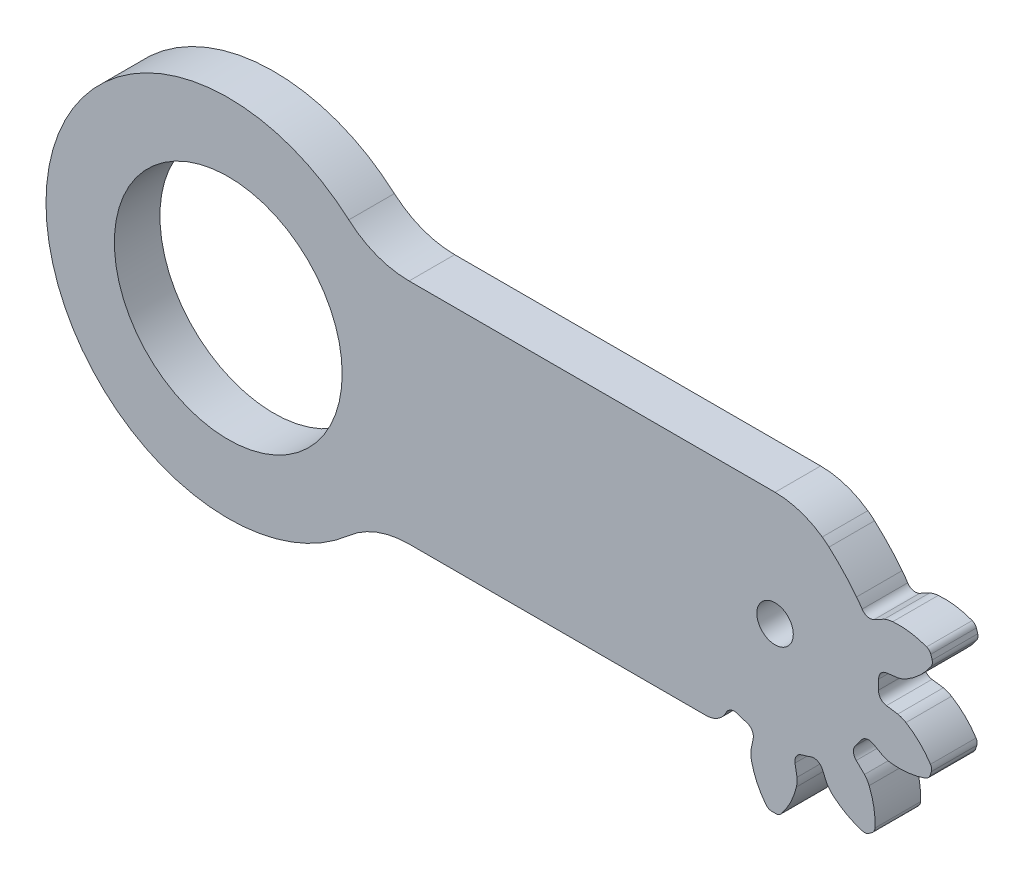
ISO-10303-21;
HEADER;
FILE_DESCRIPTION(('STEP AP214'),'2;1');
FILE_NAME('part.step','',(''),(''),'','','');
FILE_SCHEMA(('AUTOMOTIVE_DESIGN { 1 0 10303 214 1 1 1 1 }'));
ENDSEC;
DATA;
#1=APPLICATION_CONTEXT('core data for automotive mechanical design processes');
#2=APPLICATION_PROTOCOL_DEFINITION('international standard','automotive_design',2000,#1);
#3=PRODUCT_CONTEXT('',#1,'mechanical');
#4=PRODUCT('Part','Part','',(#3));
#5=PRODUCT_RELATED_PRODUCT_CATEGORY('part','',(#4));
#6=PRODUCT_DEFINITION_FORMATION('','',#4);
#7=PRODUCT_DEFINITION_CONTEXT('part definition',#1,'design');
#8=PRODUCT_DEFINITION('design','',#6,#7);
#9=PRODUCT_DEFINITION_SHAPE('','',#8);
#10=(LENGTH_UNIT() NAMED_UNIT(*) SI_UNIT(.MILLI.,.METRE.));
#11=(NAMED_UNIT(*) PLANE_ANGLE_UNIT() SI_UNIT($,.RADIAN.));
#12=(NAMED_UNIT(*) SI_UNIT($,.STERADIAN.) SOLID_ANGLE_UNIT());
#13=UNCERTAINTY_MEASURE_WITH_UNIT(LENGTH_MEASURE(1.E-05),#10,'distance_accuracy_value','');
#14=(GEOMETRIC_REPRESENTATION_CONTEXT(3) GLOBAL_UNCERTAINTY_ASSIGNED_CONTEXT((#13)) GLOBAL_UNIT_ASSIGNED_CONTEXT((#10,
#11,#12)) REPRESENTATION_CONTEXT('',''));
#15=CARTESIAN_POINT('',(0.,0.,0.));
#16=DIRECTION('',(0.,0.,1.));
#17=DIRECTION('',(1.,0.,0.));
#18=AXIS2_PLACEMENT_3D('',#15,#16,#17);
#19=CARTESIAN_POINT('',(39.6862687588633,-45.0000007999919,0.));
#20=DIRECTION('',(0.,0.,1.));
#21=DIRECTION('',(1.,0.,0.));
#22=AXIS2_PLACEMENT_3D('',#19,#20,#21);
#23=CYLINDRICAL_SURFACE('',#22,20.);
#24=DIRECTION('',(0.,0.,1.));
#25=VECTOR('',#24,1.);
#26=CARTESIAN_POINT('',(26.4575125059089,-30.0000005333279,0.));
#27=LINE('',#26,#25);
#28=CARTESIAN_POINT('',(26.4575125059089,-30.0000005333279,0.));
#29=VERTEX_POINT('',#28);
#30=CARTESIAN_POINT('',(26.4575125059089,-30.0000005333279,10.));
#31=VERTEX_POINT('',#30);
#32=EDGE_CURVE('E728',#29,#31,#27,.T.);
#33=ORIENTED_EDGE('',*,*,#32,.F.);
#34=CARTESIAN_POINT('',(39.6862687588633,-45.0000007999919,0.));
#35=DIRECTION('',(0.,0.,1.));
#36=DIRECTION('',(1.,0.,0.));
#37=AXIS2_PLACEMENT_3D('',#34,#35,#36);
#38=CIRCLE('',#37,20.);
#39=CARTESIAN_POINT('',(39.6862687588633,-25.0000007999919,0.));
#40=VERTEX_POINT('',#39);
#41=EDGE_CURVE('E46',#29,#40,#38,.F.);
#42=ORIENTED_EDGE('',*,*,#41,.T.);
#43=DIRECTION('',(0.,0.,1.));
#44=VECTOR('',#43,1.);
#45=CARTESIAN_POINT('',(39.6862687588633,-25.0000007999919,10.));
#46=LINE('',#45,#44);
#47=CARTESIAN_POINT('',(39.6862687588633,-25.0000007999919,10.));
#48=VERTEX_POINT('',#47);
#49=EDGE_CURVE('E731',#48,#40,#46,.F.);
#50=ORIENTED_EDGE('',*,*,#49,.F.);
#51=CARTESIAN_POINT('',(39.6862687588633,-45.0000007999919,10.));
#52=DIRECTION('',(0.,0.,1.));
#53=DIRECTION('',(1.,0.,0.));
#54=AXIS2_PLACEMENT_3D('',#51,#52,#53);
#55=CIRCLE('',#54,20.);
#56=EDGE_CURVE('E11',#48,#31,#55,.T.);
#57=ORIENTED_EDGE('',*,*,#56,.T.);
#58=EDGE_LOOP('',(#33,#42,#50,#57));
#59=FACE_BOUND('',#58,.T.);
#60=ADVANCED_FACE('F39',(#59),#23,.F.);
#61=CARTESIAN_POINT('',(39.6862687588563,45.0000007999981,0.));
#62=DIRECTION('',(0.,0.,1.));
#63=DIRECTION('',(1.,0.,0.));
#64=AXIS2_PLACEMENT_3D('',#61,#62,#63);
#65=CYLINDRICAL_SURFACE('',#64,20.);
#66=DIRECTION('',(0.,0.,1.));
#67=VECTOR('',#66,1.);
#68=CARTESIAN_POINT('',(26.4575125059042,30.000000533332,0.));
#69=LINE('',#68,#67);
#70=CARTESIAN_POINT('',(26.4575125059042,30.000000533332,10.));
#71=VERTEX_POINT('',#70);
#72=CARTESIAN_POINT('',(26.4575125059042,30.000000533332,0.));
#73=VERTEX_POINT('',#72);
#74=EDGE_CURVE('E720',#71,#73,#69,.F.);
#75=ORIENTED_EDGE('',*,*,#74,.F.);
#76=CARTESIAN_POINT('',(39.6862687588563,45.0000007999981,10.));
#77=DIRECTION('',(0.,0.,1.));
#78=DIRECTION('',(1.,0.,0.));
#79=AXIS2_PLACEMENT_3D('',#76,#77,#78);
#80=CIRCLE('',#79,20.);
#81=CARTESIAN_POINT('',(39.6862692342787,25.0000003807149,10.));
#82=VERTEX_POINT('',#81);
#83=EDGE_CURVE('E725',#71,#82,#80,.T.);
#84=ORIENTED_EDGE('',*,*,#83,.T.);
#85=DIRECTION('',(0.,0.,1.));
#86=VECTOR('',#85,1.);
#87=CARTESIAN_POINT('',(39.6862687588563,25.0000007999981,10.));
#88=LINE('',#87,#86);
#89=CARTESIAN_POINT('',(39.6862692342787,25.0000003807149,0.));
#90=VERTEX_POINT('',#89);
#91=EDGE_CURVE('E723',#90,#82,#88,.T.);
#92=ORIENTED_EDGE('',*,*,#91,.F.);
#93=CARTESIAN_POINT('',(39.6862687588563,45.0000007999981,0.));
#94=DIRECTION('',(0.,0.,1.));
#95=DIRECTION('',(1.,0.,0.));
#96=AXIS2_PLACEMENT_3D('',#93,#94,#95);
#97=CIRCLE('',#96,20.);
#98=EDGE_CURVE('E419',#90,#73,#97,.F.);
#99=ORIENTED_EDGE('',*,*,#98,.T.);
#100=EDGE_LOOP('',(#75,#84,#92,#99));
#101=FACE_BOUND('',#100,.T.);
#102=ADVANCED_FACE('F1124',(#101),#65,.F.);
#103=CARTESIAN_POINT('',(47.618931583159,55.0000017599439,10.));
#104=DIRECTION('',(0.,0.,1.));
#105=DIRECTION('',(1.,0.,0.));
#106=AXIS2_PLACEMENT_3D('',#103,#104,#105);
#107=PLANE('',#106);
#108=ORIENTED_EDGE('',*,*,#56,.F.);
#109=DIRECTION('',(1.,0.,0.));
#110=VECTOR('',#109,1.);
#111=CARTESIAN_POINT('',(104.827049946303,-25.0000007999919,10.));
#112=LINE('',#111,#110);
#113=CARTESIAN_POINT('',(104.827049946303,-25.0000007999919,10.));
#114=VERTEX_POINT('',#113);
#115=EDGE_CURVE('E713',#48,#114,#112,.T.);
#116=ORIENTED_EDGE('',*,*,#115,.T.);
#117=CARTESIAN_POINT('',(104.827049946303,-20.0629934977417,10.));
#118=DIRECTION('',(0.,0.,1.));
#119=DIRECTION('',(1.,0.,0.));
#120=AXIS2_PLACEMENT_3D('',#117,#118,#119);
#121=CIRCLE('',#120,4.93700730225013);
#122=CARTESIAN_POINT('',(109.271702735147,-22.2122032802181,10.));
#123=VERTEX_POINT('',#122);
#124=EDGE_CURVE('E711',#114,#123,#121,.T.);
#125=ORIENTED_EDGE('',*,*,#124,.T.);
#126=CARTESIAN_POINT('',(111.0722481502,-23.0828561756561,10.));
#127=DIRECTION('',(0.,0.,-1.));
#128=DIRECTION('',(1.,0.,0.));
#129=AXIS2_PLACEMENT_3D('',#126,#127,#128);
#130=CIRCLE('',#129,2.00000006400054);
#131=CARTESIAN_POINT('',(111.793706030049,-21.2175147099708,10.));
#132=VERTEX_POINT('',#131);
#133=EDGE_CURVE('E709',#123,#132,#130,.T.);
#134=ORIENTED_EDGE('',*,*,#133,.T.);
#135=CARTESIAN_POINT('',(120.000001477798,-8.26248791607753E-12,10.));
#136=DIRECTION('',(0.,0.,1.));
#137=DIRECTION('',(1.,0.,0.));
#138=AXIS2_PLACEMENT_3D('',#135,#136,#137);
#139=CIRCLE('',#138,22.7492025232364);
#140=CARTESIAN_POINT('',(113.78482132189,-21.8837325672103,10.));
#141=VERTEX_POINT('',#140);
#142=EDGE_CURVE('E707',#132,#141,#139,.T.);
#143=ORIENTED_EDGE('',*,*,#142,.T.);
#144=CARTESIAN_POINT('',(113.238412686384,-23.8076446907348,10.));
#145=DIRECTION('',(0.,0.,-1.));
#146=DIRECTION('',(1.,0.,0.));
#147=AXIS2_PLACEMENT_3D('',#144,#145,#146);
#148=CIRCLE('',#147,2.00000006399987);
#149=CARTESIAN_POINT('',(115.200364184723,-24.1959056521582,10.));
#150=VERTEX_POINT('',#149);
#151=EDGE_CURVE('E705',#141,#150,#148,.T.);
#152=ORIENTED_EDGE('',*,*,#151,.T.);
#153=DIRECTION('',(-0.194130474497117,-0.980975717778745,0.));
#154=VECTOR('',#153,1.);
#155=CARTESIAN_POINT('',(114.71078992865,-26.6698111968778,10.));
#156=LINE('',#155,#154);
#157=CARTESIAN_POINT('',(114.71078992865,-26.6698111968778,10.));
#158=VERTEX_POINT('',#157);
#159=EDGE_CURVE('E703',#150,#158,#156,.T.);
#160=ORIENTED_EDGE('',*,*,#159,.T.);
#161=CARTESIAN_POINT('',(120.659358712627,-27.3024649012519,10.));
#162=DIRECTION('',(0.,0.,1.));
#163=DIRECTION('',(1.,0.,0.));
#164=AXIS2_PLACEMENT_3D('',#161,#162,#163);
#165=CIRCLE('',#164,5.9821167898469);
#166=CARTESIAN_POINT('',(114.817389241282,-28.5897542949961,10.));
#167=VERTEX_POINT('',#166);
#168=EDGE_CURVE('E701',#158,#167,#165,.T.);
#169=ORIENTED_EDGE('',*,*,#168,.T.);
#170=CARTESIAN_POINT('',(131.407109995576,-24.9341768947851,10.));
#171=DIRECTION('',(0.,0.,1.));
#172=DIRECTION('',(1.,0.,0.));
#173=AXIS2_PLACEMENT_3D('',#170,#171,#172);
#174=CIRCLE('',#173,16.9877038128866);
#175=CARTESIAN_POINT('',(118.016445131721,-35.387510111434,10.));
#176=VERTEX_POINT('',#175);
#177=EDGE_CURVE('E699',#167,#176,#174,.T.);
#178=ORIENTED_EDGE('',*,*,#177,.T.);
#179=CARTESIAN_POINT('',(119.255973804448,-34.4198803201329,10.));
#180=DIRECTION('',(0.,0.,1.));
#181=DIRECTION('',(1.,0.,0.));
#182=AXIS2_PLACEMENT_3D('',#179,#180,#181);
#183=CIRCLE('',#182,1.57249443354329);
#184=CARTESIAN_POINT('',(119.185230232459,-35.9907826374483,10.));
#185=VERTEX_POINT('',#184);
#186=EDGE_CURVE('E697',#176,#185,#183,.T.);
#187=ORIENTED_EDGE('',*,*,#186,.T.);
#188=CARTESIAN_POINT('',(120.000001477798,-8.26248791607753E-12,10.));
#189=DIRECTION('',(0.,0.,1.));
#190=DIRECTION('',(1.,0.,0.));
#191=AXIS2_PLACEMENT_3D('',#188,#189,#190);
#192=CIRCLE('',#191,36.0000039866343);
#193=CARTESIAN_POINT('',(120.186522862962,-35.9995207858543,10.));
#194=VERTEX_POINT('',#193);
#195=EDGE_CURVE('E695',#185,#194,#192,.T.);
#196=ORIENTED_EDGE('',*,*,#195,.T.);
#197=CARTESIAN_POINT('',(120.143206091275,-34.427623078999,10.));
#198=DIRECTION('',(0.,0.,1.));
#199=DIRECTION('',(1.,0.,0.));
#200=AXIS2_PLACEMENT_3D('',#197,#198,#199);
#201=CIRCLE('',#200,1.57249443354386);
#202=CARTESIAN_POINT('',(121.365658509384,-35.4167382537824,10.));
#203=VERTEX_POINT('',#202);
#204=EDGE_CURVE('E693',#194,#203,#201,.T.);
#205=ORIENTED_EDGE('',*,*,#204,.T.);
#206=CARTESIAN_POINT('',(108.159468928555,-24.7312978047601,10.));
#207=DIRECTION('',(0.,0.,1.));
#208=DIRECTION('',(1.,0.,0.));
#209=AXIS2_PLACEMENT_3D('',#206,#207,#208);
#210=CIRCLE('',#209,16.9877038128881);
#211=CARTESIAN_POINT('',(124.682864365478,-28.6758489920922,10.));
#212=VERTEX_POINT('',#211);
#213=EDGE_CURVE('E691',#203,#212,#210,.T.);
#214=ORIENTED_EDGE('',*,*,#213,.T.);
#215=CARTESIAN_POINT('',(118.86425095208,-27.2867992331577,10.));
#216=DIRECTION('',(0.,0.,1.));
#217=DIRECTION('',(1.,0.,0.));
#218=AXIS2_PLACEMENT_3D('',#215,#216,#217);
#219=CIRCLE('',#218,5.98211678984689);
#220=CARTESIAN_POINT('',(124.822955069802,-26.7580587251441,10.));
#221=VERTEX_POINT('',#220);
#222=EDGE_CURVE('E689',#212,#221,#219,.T.);
#223=ORIENTED_EDGE('',*,*,#222,.T.);
#224=DIRECTION('',(-0.176980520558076,0.984214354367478,0.));
#225=VECTOR('',#224,1.);
#226=CARTESIAN_POINT('',(124.376630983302,-24.2759857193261,10.));
#227=LINE('',#226,#225);
#228=CARTESIAN_POINT('',(124.376630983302,-24.2759857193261,10.));
#229=VERTEX_POINT('',#228);
#230=EDGE_CURVE('E687',#221,#229,#227,.T.);
#231=ORIENTED_EDGE('',*,*,#230,.T.);
#232=CARTESIAN_POINT('',(126.345059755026,-23.9220246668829,10.));
#233=DIRECTION('',(0.,0.,-1.));
#234=DIRECTION('',(1.,0.,0.));
#235=AXIS2_PLACEMENT_3D('',#232,#233,#234);
#236=CIRCLE('',#235,2.00000006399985);
#237=CARTESIAN_POINT('',(125.832311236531,-21.9888694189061,10.));
#238=VERTEX_POINT('',#237);
#239=EDGE_CURVE('E685',#229,#238,#236,.T.);
#240=ORIENTED_EDGE('',*,*,#239,.T.);
#241=CARTESIAN_POINT('',(120.000001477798,-8.26248791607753E-12,10.));
#242=DIRECTION('',(0.,0.,1.));
#243=DIRECTION('',(1.,0.,0.));
#244=AXIS2_PLACEMENT_3D('',#241,#242,#243);
#245=CIRCLE('',#244,22.7492025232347);
#246=CARTESIAN_POINT('',(127.83475037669,-21.3575027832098,10.));
#247=VERTEX_POINT('',#246);
#248=EDGE_CURVE('E683',#238,#247,#245,.T.);
#249=ORIENTED_EDGE('',*,*,#248,.T.);
#250=CARTESIAN_POINT('',(128.523543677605,-23.2351513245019,10.));
#251=DIRECTION('',(0.,0.,-1.));
#252=DIRECTION('',(1.,0.,0.));
#253=AXIS2_PLACEMENT_3D('',#250,#251,#252);
#254=CIRCLE('',#253,2.00000006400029);
#255=CARTESIAN_POINT('',(130.339009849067,-22.396054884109,10.));
#256=VERTEX_POINT('',#255);
#257=EDGE_CURVE('E681',#247,#256,#254,.T.);
#258=ORIENTED_EDGE('',*,*,#257,.T.);
#259=DIRECTION('',(0.419548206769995,-0.907733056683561,0.));
#260=VECTOR('',#259,1.);
#261=CARTESIAN_POINT('',(131.39706115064,-24.6852510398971,10.));
#262=LINE('',#261,#260);
#263=CARTESIAN_POINT('',(131.39706115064,-24.6852510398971,10.));
#264=VERTEX_POINT('',#263);
#265=EDGE_CURVE('E679',#256,#264,#262,.T.);
#266=ORIENTED_EDGE('',*,*,#265,.T.);
#267=CARTESIAN_POINT('',(136.58141890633,-21.7005976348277,10.));
#268=DIRECTION('',(0.,0.,1.));
#269=DIRECTION('',(1.,0.,0.));
#270=AXIS2_PLACEMENT_3D('',#267,#268,#269);
#271=CIRCLE('',#270,5.98211678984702);
#272=CARTESIAN_POINT('',(132.611816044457,-26.1758601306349,10.));
#273=VERTEX_POINT('',#272);
#274=EDGE_CURVE('E677',#264,#273,#271,.T.);
#275=ORIENTED_EDGE('',*,*,#274,.T.);
#276=CARTESIAN_POINT('',(143.884487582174,-13.4672426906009,10.));
#277=DIRECTION('',(0.,0.,1.));
#278=DIRECTION('',(1.,0.,0.));
#279=AXIS2_PLACEMENT_3D('',#276,#277,#278);
#280=CIRCLE('',#279,16.9877038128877);
#281=CARTESIAN_POINT('',(139.195527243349,-29.7950022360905,10.));
#282=VERTEX_POINT('',#281);
#283=EDGE_CURVE('E675',#273,#282,#280,.T.);
#284=ORIENTED_EDGE('',*,*,#283,.T.);
#285=CARTESIAN_POINT('',(139.629568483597,-28.2835966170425,10.));
#286=DIRECTION('',(0.,0.,1.));
#287=DIRECTION('',(1.,0.,0.));
#288=AXIS2_PLACEMENT_3D('',#285,#286,#287);
#289=CIRCLE('',#288,1.57249443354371);
#290=CARTESIAN_POINT('',(140.495688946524,-29.596065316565,10.));
#291=VERTEX_POINT('',#290);
#292=EDGE_CURVE('E673',#282,#291,#289,.T.);
#293=ORIENTED_EDGE('',*,*,#292,.T.);
#294=CARTESIAN_POINT('',(120.000001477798,-8.26248791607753E-12,10.));
#295=DIRECTION('',(0.,0.,1.));
#296=DIRECTION('',(1.,0.,0.));
#297=AXIS2_PLACEMENT_3D('',#294,#295,#296);
#298=CIRCLE('',#297,36.0000039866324);
#299=CARTESIAN_POINT('',(141.310887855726,-29.0145895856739,10.));
#300=VERTEX_POINT('',#299);
#301=EDGE_CURVE('E671',#291,#300,#298,.T.);
#302=ORIENTED_EDGE('',*,*,#301,.T.);
#303=CARTESIAN_POINT('',(140.351905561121,-27.7683585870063,10.));
#304=DIRECTION('',(0.,0.,1.));
#305=DIRECTION('',(1.,0.,0.));
#306=AXIS2_PLACEMENT_3D('',#303,#304,#305);
#307=CIRCLE('',#306,1.57249443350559);
#308=CARTESIAN_POINT('',(141.922277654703,-27.8500300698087,10.));
#309=VERTEX_POINT('',#308);
#310=EDGE_CURVE('E669',#300,#309,#307,.T.);
#311=ORIENTED_EDGE('',*,*,#310,.T.);
#312=CARTESIAN_POINT('',(124.957501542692,-26.9677306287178,10.));
#313=DIRECTION('',(0.,0.,1.));
#314=DIRECTION('',(1.,0.,0.));
#315=AXIS2_PLACEMENT_3D('',#312,#313,#314);
#316=CIRCLE('',#315,16.9877038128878);
#317=CARTESIAN_POINT('',(140.643758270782,-20.4467314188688,10.));
#318=VERTEX_POINT('',#317);
#319=EDGE_CURVE('E667',#309,#318,#316,.T.);
#320=ORIENTED_EDGE('',*,*,#319,.T.);
#321=CARTESIAN_POINT('',(135.119938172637,-22.7430617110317,10.));
#322=DIRECTION('',(0.,0.,1.));
#323=DIRECTION('',(1.,0.,0.));
#324=AXIS2_PLACEMENT_3D('',#321,#322,#323);
#325=CIRCLE('',#324,5.98211678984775);
#326=CARTESIAN_POINT('',(139.629845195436,-18.8128632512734,10.));
#327=VERTEX_POINT('',#326);
#328=EDGE_CURVE('E665',#318,#327,#325,.T.);
#329=ORIENTED_EDGE('',*,*,#328,.T.);
#330=DIRECTION('',(-0.721686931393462,0.692219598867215,0.));
#331=VECTOR('',#330,1.);
#332=CARTESIAN_POINT('',(137.809835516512,-17.0671667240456,10.));
#333=LINE('',#332,#331);
#334=CARTESIAN_POINT('',(137.809835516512,-17.0671667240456,10.));
#335=VERTEX_POINT('',#334);
#336=EDGE_CURVE('E663',#327,#335,#333,.T.);
#337=ORIENTED_EDGE('',*,*,#336,.T.);
#338=CARTESIAN_POINT('',(139.194274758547,-15.623792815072,10.));
#339=DIRECTION('',(0.,0.,-1.));
#340=DIRECTION('',(1.,0.,0.));
#341=AXIS2_PLACEMENT_3D('',#338,#339,#340);
#342=CIRCLE('',#341,2.00000006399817);
#343=CARTESIAN_POINT('',(137.643172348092,-14.3612233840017,10.));
#344=VERTEX_POINT('',#343);
#345=EDGE_CURVE('E661',#335,#344,#342,.T.);
#346=ORIENTED_EDGE('',*,*,#345,.T.);
#347=CARTESIAN_POINT('',(120.000001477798,-8.26248791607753E-12,10.));
#348=DIRECTION('',(0.,0.,1.));
#349=DIRECTION('',(1.,0.,0.));
#350=AXIS2_PLACEMENT_3D('',#347,#348,#349);
#351=CIRCLE('',#350,22.7492025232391);
#352=CARTESIAN_POINT('',(138.892071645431,-12.6734328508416,10.));
#353=VERTEX_POINT('',#352);
#354=EDGE_CURVE('E659',#344,#353,#351,.T.);
#355=ORIENTED_EDGE('',*,*,#354,.T.);
#356=CARTESIAN_POINT('',(140.552971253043,-13.7876198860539,10.));
#357=DIRECTION('',(0.,0.,-1.));
#358=DIRECTION('',(1.,0.,0.));
#359=AXIS2_PLACEMENT_3D('',#356,#357,#358);
#360=CIRCLE('',#359,2.00000006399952);
#361=CARTESIAN_POINT('',(141.528505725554,-12.0416723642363,10.));
#362=VERTEX_POINT('',#361);
#363=EDGE_CURVE('E657',#353,#362,#360,.T.);
#364=ORIENTED_EDGE('',*,*,#363,.T.);
#365=DIRECTION('',(0.872973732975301,-0.487767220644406,0.));
#366=VECTOR('',#365,1.);
#367=CARTESIAN_POINT('',(143.730042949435,-13.2717640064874,10.));
#368=LINE('',#367,#366);
#369=CARTESIAN_POINT('',(143.730042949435,-13.2717640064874,10.));
#370=VERTEX_POINT('',#369);
#371=EDGE_CURVE('E655',#362,#370,#368,.T.);
#372=ORIENTED_EDGE('',*,*,#371,.T.);
#373=CARTESIAN_POINT('',(146.169941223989,-7.80983964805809,10.));
#374=DIRECTION('',(0.,0.,1.));
#375=DIRECTION('',(1.,0.,0.));
#376=AXIS2_PLACEMENT_3D('',#373,#374,#375);
#377=CIRCLE('',#376,5.98211678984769);
#378=CARTESIAN_POINT('',(145.588958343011,-13.7636770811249,10.));
#379=VERTEX_POINT('',#378);
#380=EDGE_CURVE('E653',#370,#379,#377,.T.);
#381=ORIENTED_EDGE('',*,*,#380,.T.);
#382=CARTESIAN_POINT('',(147.238803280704,3.14372048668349,10.));
#383=DIRECTION('',(0.,0.,1.));
#384=DIRECTION('',(1.,0.,0.));
#385=AXIS2_PLACEMENT_3D('',#382,#383,#384);
#386=CIRCLE('',#385,16.9877038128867);
#387=CARTESIAN_POINT('',(153.042570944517,-12.8218162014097,10.));
#388=VERTEX_POINT('',#387);
#389=EDGE_CURVE('E651',#379,#388,#386,.T.);
#390=ORIENTED_EDGE('',*,*,#389,.T.);
#391=CARTESIAN_POINT('',(152.505335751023,-11.3439403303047,10.));
#392=DIRECTION('',(0.,0.,1.));
#393=DIRECTION('',(1.,0.,0.));
#394=AXIS2_PLACEMENT_3D('',#391,#392,#393);
#395=CIRCLE('',#394,1.57249443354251);
#396=CARTESIAN_POINT('',(153.977491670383,-11.8966569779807,10.));
#397=VERTEX_POINT('',#396);
#398=EDGE_CURVE('E649',#388,#397,#395,.T.);
#399=ORIENTED_EDGE('',*,*,#398,.T.);
#400=CARTESIAN_POINT('',(120.000001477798,-8.26248791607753E-12,10.));
#401=DIRECTION('',(0.,0.,1.));
#402=DIRECTION('',(1.,0.,0.));
#403=AXIS2_PLACEMENT_3D('',#400,#401,#402);
#404=CIRCLE('',#403,36.0000039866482);
#405=CARTESIAN_POINT('',(154.295218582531,-10.9470713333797,10.));
#406=VERTEX_POINT('',#405);
#407=EDGE_CURVE('E647',#397,#406,#404,.T.);
#408=ORIENTED_EDGE('',*,*,#407,.T.);
#409=CARTESIAN_POINT('',(152.786869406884,-10.5025249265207,10.));
#410=DIRECTION('',(0.,0.,1.));
#411=DIRECTION('',(1.,0.,0.));
#412=AXIS2_PLACEMENT_3D('',#409,#410,#411);
#413=CIRCLE('',#412,1.57249443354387);
#414=CARTESIAN_POINT('',(154.105332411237,-9.64555698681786,10.));
#415=VERTEX_POINT('',#414);
#416=EDGE_CURVE('E645',#406,#415,#413,.T.);
#417=ORIENTED_EDGE('',*,*,#416,.T.);
#418=CARTESIAN_POINT('',(139.861937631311,-18.9034069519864,10.));
#419=DIRECTION('',(0.,0.,1.));
#420=DIRECTION('',(1.,0.,0.));
#421=AXIS2_PLACEMENT_3D('',#418,#419,#420);
#422=CIRCLE('',#421,16.9877038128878);
#423=CARTESIAN_POINT('',(148.719438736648,-4.40765740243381,10.));
#424=VERTEX_POINT('',#423);
#425=EDGE_CURVE('E643',#415,#424,#422,.T.);
#426=ORIENTED_EDGE('',*,*,#425,.T.);
#427=CARTESIAN_POINT('',(145.600323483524,-9.5122476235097,10.));
#428=DIRECTION('',(0.,0.,1.));
#429=DIRECTION('',(1.,0.,0.));
#430=AXIS2_PLACEMENT_3D('',#427,#428,#429);
#431=CIRCLE('',#430,5.98211678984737);
#432=CARTESIAN_POINT('',(146.938802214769,-3.68179344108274,10.));
#433=VERTEX_POINT('',#432);
#434=EDGE_CURVE('E641',#424,#433,#431,.T.);
#435=ORIENTED_EDGE('',*,*,#434,.T.);
#436=DIRECTION('',(-0.990733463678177,0.135820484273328,0.));
#437=VECTOR('',#436,1.);
#438=CARTESIAN_POINT('',(144.440288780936,-3.33927013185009,10.));
#439=LINE('',#438,#437);
#440=CARTESIAN_POINT('',(144.440288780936,-3.33927013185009,10.));
#441=VERTEX_POINT('',#440);
#442=EDGE_CURVE('E639',#433,#441,#439,.T.);
#443=ORIENTED_EDGE('',*,*,#442,.T.);
#444=CARTESIAN_POINT('',(144.711929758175,-1.35780314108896,10.));
#445=DIRECTION('',(0.,0.,-1.));
#446=DIRECTION('',(1.,0.,0.));
#447=AXIS2_PLACEMENT_3D('',#444,#445,#446);
#448=CIRCLE('',#447,2.00000006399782);
#449=CARTESIAN_POINT('',(142.714941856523,-1.24807813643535,10.));
#450=VERTEX_POINT('',#449);
#451=EDGE_CURVE('E637',#441,#450,#448,.T.);
#452=ORIENTED_EDGE('',*,*,#451,.T.);
#453=CARTESIAN_POINT('',(120.000001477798,-8.26248791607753E-12,10.));
#454=DIRECTION('',(0.,0.,1.));
#455=DIRECTION('',(1.,0.,0.));
#456=AXIS2_PLACEMENT_3D('',#453,#454,#455);
#457=CIRCLE('',#456,22.7492025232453);
#458=CARTESIAN_POINT('',(142.733264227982,0.851457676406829,10.));
#459=VERTEX_POINT('',#458);
#460=EDGE_CURVE('E635',#450,#459,#457,.T.);
#461=ORIENTED_EDGE('',*,*,#460,.T.);
#462=CARTESIAN_POINT('',(144.731862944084,0.926313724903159,10.));
#463=DIRECTION('',(0.,0.,-1.));
#464=DIRECTION('',(1.,0.,0.));
#465=AXIS2_PLACEMENT_3D('',#462,#463,#464);
#466=CIRCLE('',#465,2.0000000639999);
#467=CARTESIAN_POINT('',(144.494844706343,2.91221971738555,10.));
#468=VERTEX_POINT('',#467);
#469=EDGE_CURVE('E633',#459,#468,#466,.T.);
#470=ORIENTED_EDGE('',*,*,#469,.T.);
#471=DIRECTION('',(0.992952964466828,0.118509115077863,0.));
#472=VECTOR('',#471,1.);
#473=CARTESIAN_POINT('',(146.99895546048,3.21108578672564,10.));
#474=LINE('',#473,#472);
#475=CARTESIAN_POINT('',(146.99895546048,3.21108578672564,10.));
#476=VERTEX_POINT('',#475);
#477=EDGE_CURVE('E631',#468,#476,#474,.T.);
#478=ORIENTED_EDGE('',*,*,#477,.T.);
#479=CARTESIAN_POINT('',(145.762436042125,9.06401163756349,10.));
#480=DIRECTION('',(0.,0.,1.));
#481=DIRECTION('',(1.,0.,0.));
#482=AXIS2_PLACEMENT_3D('',#479,#480,#481);
#483=CIRCLE('',#482,5.98211678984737);
#484=CARTESIAN_POINT('',(148.791988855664,3.90576280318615,10.));
#485=VERTEX_POINT('',#484);
#486=EDGE_CURVE('E629',#476,#485,#483,.T.);
#487=ORIENTED_EDGE('',*,*,#486,.T.);
#488=CARTESIAN_POINT('',(140.188822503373,18.5538892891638,10.));
#489=DIRECTION('',(0.,0.,1.));
#490=DIRECTION('',(1.,0.,0.));
#491=AXIS2_PLACEMENT_3D('',#488,#489,#490);
#492=CIRCLE('',#491,16.9877038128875);
#493=CARTESIAN_POINT('',(154.268476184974,9.04886782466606,10.));
#494=VERTEX_POINT('',#493);
#495=EDGE_CURVE('E627',#485,#494,#492,.T.);
#496=ORIENTED_EDGE('',*,*,#495,.T.);
#497=CARTESIAN_POINT('',(152.965170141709,9.92871559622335,10.));
#498=DIRECTION('',(0.,0.,1.));
#499=DIRECTION('',(1.,0.,0.));
#500=AXIS2_PLACEMENT_3D('',#497,#498,#499);
#501=CIRCLE('',#500,1.57249443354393);
#502=CARTESIAN_POINT('',(154.481047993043,10.3468699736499,10.));
#503=VERTEX_POINT('',#502);
#504=EDGE_CURVE('E625',#494,#503,#501,.T.);
#505=ORIENTED_EDGE('',*,*,#504,.T.);
#506=CARTESIAN_POINT('',(120.000001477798,-8.26248791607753E-12,10.));
#507=DIRECTION('',(0.,0.,1.));
#508=DIRECTION('',(1.,0.,0.));
#509=AXIS2_PLACEMENT_3D('',#506,#507,#508);
#510=CIRCLE('',#509,36.000003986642);
#511=CARTESIAN_POINT('',(154.179942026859,11.3018560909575,10.));
#512=VERTEX_POINT('',#511);
#513=EDGE_CURVE('E623',#503,#512,#510,.T.);
#514=ORIENTED_EDGE('',*,*,#513,.T.);
#515=CARTESIAN_POINT('',(152.698364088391,10.7749162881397,10.));
#516=DIRECTION('',(0.,0.,1.));
#517=DIRECTION('',(1.,0.,0.));
#518=AXIS2_PLACEMENT_3D('',#515,#516,#517);
#519=CIRCLE('',#518,1.57249443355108);
#520=CARTESIAN_POINT('',(153.261309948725,12.2431910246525,10.));
#521=VERTEX_POINT('',#520);
#522=EDGE_CURVE('E621',#512,#521,#519,.T.);
#523=ORIENTED_EDGE('',*,*,#522,.T.);
#524=CARTESIAN_POINT('',(147.179789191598,-3.61862432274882,10.));
#525=DIRECTION('',(0.,0.,1.));
#526=DIRECTION('',(1.,0.,0.));
#527=AXIS2_PLACEMENT_3D('',#524,#525,#526);
#528=CIRCLE('',#527,16.9877038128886);
#529=CARTESIAN_POINT('',(145.825270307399,13.3149919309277,10.));
#530=VERTEX_POINT('',#529);
#531=EDGE_CURVE('E619',#521,#530,#528,.T.);
#532=ORIENTED_EDGE('',*,*,#531,.T.);
#533=CARTESIAN_POINT('',(146.302255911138,7.35192174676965,10.));
#534=DIRECTION('',(0.,0.,1.));
#535=DIRECTION('',(1.,0.,0.));
#536=AXIS2_PLACEMENT_3D('',#533,#534,#535);
#537=CIRCLE('',#536,5.98211678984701);
#538=CARTESIAN_POINT('',(143.95805296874,12.8555963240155,10.));
#539=VERTEX_POINT('',#538);
#540=EDGE_CURVE('E617',#530,#539,#537,.T.);
#541=ORIENTED_EDGE('',*,*,#540,.T.);
#542=DIRECTION('',(-0.881353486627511,-0.472457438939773,0.));
#543=VECTOR('',#542,1.);
#544=CARTESIAN_POINT('',(141.735382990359,11.6641141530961,10.));
#545=LINE('',#544,#543);
#546=CARTESIAN_POINT('',(141.735382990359,11.6641141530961,10.));
#547=VERTEX_POINT('',#546);
#548=EDGE_CURVE('E615',#539,#547,#545,.T.);
#549=ORIENTED_EDGE('',*,*,#548,.T.);
#550=CARTESIAN_POINT('',(140.790468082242,13.4268211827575,10.));
#551=DIRECTION('',(0.,0.,-1.));
#552=DIRECTION('',(1.,0.,0.));
#553=AXIS2_PLACEMENT_3D('',#550,#551,#552);
#554=CIRCLE('',#553,2.00000006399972);
#555=CARTESIAN_POINT('',(139.110376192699,12.3417905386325,10.));
#556=VERTEX_POINT('',#555);
#557=EDGE_CURVE('E613',#547,#556,#554,.T.);
#558=ORIENTED_EDGE('',*,*,#557,.T.);
#559=CARTESIAN_POINT('',(120.000001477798,-8.26248791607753E-12,10.));
#560=DIRECTION('',(0.,0.,1.));
#561=DIRECTION('',(1.,0.,0.));
#562=AXIS2_PLACEMENT_3D('',#559,#560,#561);
#563=CIRCLE('',#562,22.7492025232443);
#564=CARTESIAN_POINT('',(137.891123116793,14.051120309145,10.));
#565=VERTEX_POINT('',#564);
#566=EDGE_CURVE('E611',#556,#565,#563,.T.);
#567=ORIENTED_EDGE('',*,*,#566,.T.);
#568=CARTESIAN_POINT('',(98.6618039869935,-16.7582658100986,10.));
#569=DIRECTION('',(0.,0.,1.));
#570=DIRECTION('',(1.,0.,0.));
#571=AXIS2_PLACEMENT_3D('',#568,#569,#570);
#572=CIRCLE('',#571,49.8814369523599);
#573=CARTESIAN_POINT('',(131.832986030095,20.4953304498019,10.));
#574=VERTEX_POINT('',#573);
#575=EDGE_CURVE('E609',#565,#574,#572,.T.);
#576=ORIENTED_EDGE('',*,*,#575,.T.);
#577=CARTESIAN_POINT('',(119.999902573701,7.20593627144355,10.));
#578=DIRECTION('',(0.,0.,1.));
#579=DIRECTION('',(1.,0.,0.));
#580=AXIS2_PLACEMENT_3D('',#577,#578,#579);
#581=CIRCLE('',#580,17.7940962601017);
#582=CARTESIAN_POINT('',(130.352034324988,21.6787808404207,10.));
#583=VERTEX_POINT('',#582);
#584=EDGE_CURVE('E607',#574,#583,#581,.T.);
#585=ORIENTED_EDGE('',*,*,#584,.T.);
#586=CARTESIAN_POINT('',(120.000001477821,7.20607454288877,10.));
#587=DIRECTION('',(0.,0.,1.));
#588=DIRECTION('',(1.,0.,0.));
#589=AXIS2_PLACEMENT_3D('',#586,#587,#588);
#590=CIRCLE('',#589,17.7939262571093);
#591=CARTESIAN_POINT('',(120.00000147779,25.0000007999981,10.));
#592=VERTEX_POINT('',#591);
#593=EDGE_CURVE('E605',#583,#592,#590,.T.);
#594=ORIENTED_EDGE('',*,*,#593,.T.);
#595=DIRECTION('',(-1.,0.,0.));
#596=VECTOR('',#595,1.);
#597=CARTESIAN_POINT('',(47.6189315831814,25.0000007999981,10.));
#598=LINE('',#597,#596);
#599=CARTESIAN_POINT('',(47.6189315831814,25.0000007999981,10.));
#600=VERTEX_POINT('',#599);
#601=EDGE_CURVE('E602',#592,#600,#598,.T.);
#602=ORIENTED_EDGE('',*,*,#601,.T.);
#603=DIRECTION('',(0.999999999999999,5.28552856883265E-08,0.));
#604=VECTOR('',#603,1.);
#605=CARTESIAN_POINT('',(34.6779828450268,25.0000001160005,10.));
#606=LINE('',#605,#604);
#607=EDGE_CURVE('E424',#82,#600,#606,.T.);
#608=ORIENTED_EDGE('',*,*,#607,.F.);
#609=ORIENTED_EDGE('',*,*,#83,.F.);
#610=CARTESIAN_POINT('',(0.,0.,10.));
#611=DIRECTION('',(0.,0.,1.));
#612=DIRECTION('',(1.,0.,0.));
#613=AXIS2_PLACEMENT_3D('',#610,#611,#612);
#614=CIRCLE('',#613,40.);
#615=EDGE_CURVE('E423',#71,#31,#614,.T.);
#616=ORIENTED_EDGE('',*,*,#615,.T.);
#617=EDGE_LOOP('',(#108,#116,#125,#134,#143,#152,#160,#169,#178,#187,#196,#205,#214,#223,#231,
#240,#249,#258,#266,#275,#284,#293,#302,#311,#320,#329,#337,#346,#355,#364,#372,#381,#390,#399,
#408,#417,#426,#435,#443,#452,#461,#470,#478,#487,#496,#505,#514,#523,#532,#541,#549,#558,#567,
#576,#585,#594,#602,#608,#609,#616));
#618=FACE_BOUND('',#617,.T.);
#619=CARTESIAN_POINT('',(120.000001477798,-8.26248791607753E-12,10.));
#620=DIRECTION('',(0.,0.,1.));
#621=DIRECTION('',(1.,0.,0.));
#622=AXIS2_PLACEMENT_3D('',#619,#620,#621);
#623=CIRCLE('',#622,4.00000012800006);
#624=CARTESIAN_POINT('',(124.000001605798,-8.26248791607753E-12,10.));
#625=VERTEX_POINT('',#624);
#626=EDGE_CURVE('E433',#625,#625,#623,.T.);
#627=ORIENTED_EDGE('',*,*,#626,.F.);
#628=EDGE_LOOP('',(#627));
#629=FACE_BOUND('',#628,.T.);
#630=CARTESIAN_POINT('',(0.,0.,10.));
#631=DIRECTION('',(0.,0.,1.));
#632=DIRECTION('',(1.,0.,0.));
#633=AXIS2_PLACEMENT_3D('',#630,#631,#632);
#634=CIRCLE('',#633,25.);
#635=CARTESIAN_POINT('',(25.,0.,10.));
#636=VERTEX_POINT('',#635);
#637=EDGE_CURVE('E1137',#636,#636,#634,.T.);
#638=ORIENTED_EDGE('',*,*,#637,.F.);
#639=EDGE_LOOP('',(#638));
#640=FACE_BOUND('',#639,.T.);
#641=ADVANCED_FACE('F868',(#618,#629,#640),#107,.T.);
#642=CARTESIAN_POINT('',(47.618931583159,55.0000017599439,0.));
#643=DIRECTION('',(0.,0.,1.));
#644=DIRECTION('',(1.,0.,0.));
#645=AXIS2_PLACEMENT_3D('',#642,#643,#644);
#646=PLANE('',#645);
#647=ORIENTED_EDGE('',*,*,#98,.F.);
#648=DIRECTION('',(0.999999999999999,5.28552856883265E-08,0.));
#649=VECTOR('',#648,1.);
#650=CARTESIAN_POINT('',(34.6779828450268,25.0000001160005,0.));
#651=LINE('',#650,#649);
#652=CARTESIAN_POINT('',(47.6189315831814,25.0000007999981,0.));
#653=VERTEX_POINT('',#652);
#654=EDGE_CURVE('E412',#90,#653,#651,.T.);
#655=ORIENTED_EDGE('',*,*,#654,.T.);
#656=DIRECTION('',(-1.,0.,0.));
#657=VECTOR('',#656,1.);
#658=CARTESIAN_POINT('',(47.6189315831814,25.0000007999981,0.));
#659=LINE('',#658,#657);
#660=CARTESIAN_POINT('',(120.00000147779,25.0000007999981,0.));
#661=VERTEX_POINT('',#660);
#662=EDGE_CURVE('E417',#661,#653,#659,.T.);
#663=ORIENTED_EDGE('',*,*,#662,.F.);
#664=CARTESIAN_POINT('',(120.000001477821,7.20607454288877,0.));
#665=DIRECTION('',(0.,0.,1.));
#666=DIRECTION('',(1.,0.,0.));
#667=AXIS2_PLACEMENT_3D('',#664,#665,#666);
#668=CIRCLE('',#667,17.7939262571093);
#669=CARTESIAN_POINT('',(130.352034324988,21.6787808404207,0.));
#670=VERTEX_POINT('',#669);
#671=EDGE_CURVE('E436',#670,#661,#668,.T.);
#672=ORIENTED_EDGE('',*,*,#671,.F.);
#673=CARTESIAN_POINT('',(119.999902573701,7.20593627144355,0.));
#674=DIRECTION('',(0.,0.,1.));
#675=DIRECTION('',(1.,0.,0.));
#676=AXIS2_PLACEMENT_3D('',#673,#674,#675);
#677=CIRCLE('',#676,17.7940962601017);
#678=CARTESIAN_POINT('',(131.832986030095,20.4953304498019,0.));
#679=VERTEX_POINT('',#678);
#680=EDGE_CURVE('E441',#679,#670,#677,.T.);
#681=ORIENTED_EDGE('',*,*,#680,.F.);
#682=CARTESIAN_POINT('',(98.6618039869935,-16.7582658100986,0.));
#683=DIRECTION('',(0.,0.,1.));
#684=DIRECTION('',(1.,0.,0.));
#685=AXIS2_PLACEMENT_3D('',#682,#683,#684);
#686=CIRCLE('',#685,49.8814369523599);
#687=CARTESIAN_POINT('',(137.891123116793,14.051120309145,0.));
#688=VERTEX_POINT('',#687);
#689=EDGE_CURVE('E444',#688,#679,#686,.T.);
#690=ORIENTED_EDGE('',*,*,#689,.F.);
#691=CARTESIAN_POINT('',(120.000001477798,-8.26248791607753E-12,0.));
#692=DIRECTION('',(0.,0.,1.));
#693=DIRECTION('',(1.,0.,0.));
#694=AXIS2_PLACEMENT_3D('',#691,#692,#693);
#695=CIRCLE('',#694,22.7492025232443);
#696=CARTESIAN_POINT('',(139.110376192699,12.3417905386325,0.));
#697=VERTEX_POINT('',#696);
#698=EDGE_CURVE('E447',#697,#688,#695,.T.);
#699=ORIENTED_EDGE('',*,*,#698,.F.);
#700=CARTESIAN_POINT('',(140.790468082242,13.4268211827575,0.));
#701=DIRECTION('',(0.,0.,-1.));
#702=DIRECTION('',(1.,0.,0.));
#703=AXIS2_PLACEMENT_3D('',#700,#701,#702);
#704=CIRCLE('',#703,2.00000006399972);
#705=CARTESIAN_POINT('',(141.735382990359,11.6641141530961,0.));
#706=VERTEX_POINT('',#705);
#707=EDGE_CURVE('E450',#706,#697,#704,.T.);
#708=ORIENTED_EDGE('',*,*,#707,.F.);
#709=DIRECTION('',(-0.881353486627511,-0.472457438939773,0.));
#710=VECTOR('',#709,1.);
#711=CARTESIAN_POINT('',(141.735382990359,11.6641141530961,0.));
#712=LINE('',#711,#710);
#713=CARTESIAN_POINT('',(143.95805296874,12.8555963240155,0.));
#714=VERTEX_POINT('',#713);
#715=EDGE_CURVE('E453',#714,#706,#712,.T.);
#716=ORIENTED_EDGE('',*,*,#715,.F.);
#717=CARTESIAN_POINT('',(146.302255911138,7.35192174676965,0.));
#718=DIRECTION('',(0.,0.,1.));
#719=DIRECTION('',(1.,0.,0.));
#720=AXIS2_PLACEMENT_3D('',#717,#718,#719);
#721=CIRCLE('',#720,5.98211678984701);
#722=CARTESIAN_POINT('',(145.825270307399,13.3149919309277,0.));
#723=VERTEX_POINT('',#722);
#724=EDGE_CURVE('E456',#723,#714,#721,.T.);
#725=ORIENTED_EDGE('',*,*,#724,.F.);
#726=CARTESIAN_POINT('',(147.179789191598,-3.61862432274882,0.));
#727=DIRECTION('',(0.,0.,1.));
#728=DIRECTION('',(1.,0.,0.));
#729=AXIS2_PLACEMENT_3D('',#726,#727,#728);
#730=CIRCLE('',#729,16.9877038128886);
#731=CARTESIAN_POINT('',(153.261309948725,12.2431910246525,0.));
#732=VERTEX_POINT('',#731);
#733=EDGE_CURVE('E459',#732,#723,#730,.T.);
#734=ORIENTED_EDGE('',*,*,#733,.F.);
#735=CARTESIAN_POINT('',(152.698364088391,10.7749162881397,0.));
#736=DIRECTION('',(0.,0.,1.));
#737=DIRECTION('',(1.,0.,0.));
#738=AXIS2_PLACEMENT_3D('',#735,#736,#737);
#739=CIRCLE('',#738,1.57249443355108);
#740=CARTESIAN_POINT('',(154.179942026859,11.3018560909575,0.));
#741=VERTEX_POINT('',#740);
#742=EDGE_CURVE('E462',#741,#732,#739,.T.);
#743=ORIENTED_EDGE('',*,*,#742,.F.);
#744=CARTESIAN_POINT('',(120.000001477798,-8.26248791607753E-12,0.));
#745=DIRECTION('',(0.,0.,1.));
#746=DIRECTION('',(1.,0.,0.));
#747=AXIS2_PLACEMENT_3D('',#744,#745,#746);
#748=CIRCLE('',#747,36.000003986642);
#749=CARTESIAN_POINT('',(154.481047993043,10.3468699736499,0.));
#750=VERTEX_POINT('',#749);
#751=EDGE_CURVE('E465',#750,#741,#748,.T.);
#752=ORIENTED_EDGE('',*,*,#751,.F.);
#753=CARTESIAN_POINT('',(152.965170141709,9.92871559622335,0.));
#754=DIRECTION('',(0.,0.,1.));
#755=DIRECTION('',(1.,0.,0.));
#756=AXIS2_PLACEMENT_3D('',#753,#754,#755);
#757=CIRCLE('',#756,1.57249443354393);
#758=CARTESIAN_POINT('',(154.268476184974,9.04886782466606,0.));
#759=VERTEX_POINT('',#758);
#760=EDGE_CURVE('E468',#759,#750,#757,.T.);
#761=ORIENTED_EDGE('',*,*,#760,.F.);
#762=CARTESIAN_POINT('',(140.188822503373,18.5538892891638,0.));
#763=DIRECTION('',(0.,0.,1.));
#764=DIRECTION('',(1.,0.,0.));
#765=AXIS2_PLACEMENT_3D('',#762,#763,#764);
#766=CIRCLE('',#765,16.9877038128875);
#767=CARTESIAN_POINT('',(148.791988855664,3.90576280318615,0.));
#768=VERTEX_POINT('',#767);
#769=EDGE_CURVE('E471',#768,#759,#766,.T.);
#770=ORIENTED_EDGE('',*,*,#769,.F.);
#771=CARTESIAN_POINT('',(145.762436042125,9.06401163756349,0.));
#772=DIRECTION('',(0.,0.,1.));
#773=DIRECTION('',(1.,0.,0.));
#774=AXIS2_PLACEMENT_3D('',#771,#772,#773);
#775=CIRCLE('',#774,5.98211678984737);
#776=CARTESIAN_POINT('',(146.99895546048,3.21108578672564,0.));
#777=VERTEX_POINT('',#776);
#778=EDGE_CURVE('E474',#777,#768,#775,.T.);
#779=ORIENTED_EDGE('',*,*,#778,.F.);
#780=DIRECTION('',(0.992952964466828,0.118509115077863,0.));
#781=VECTOR('',#780,1.);
#782=CARTESIAN_POINT('',(146.99895546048,3.21108578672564,0.));
#783=LINE('',#782,#781);
#784=CARTESIAN_POINT('',(144.494844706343,2.91221971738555,0.));
#785=VERTEX_POINT('',#784);
#786=EDGE_CURVE('E477',#785,#777,#783,.T.);
#787=ORIENTED_EDGE('',*,*,#786,.F.);
#788=CARTESIAN_POINT('',(144.731862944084,0.926313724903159,0.));
#789=DIRECTION('',(0.,0.,-1.));
#790=DIRECTION('',(1.,0.,0.));
#791=AXIS2_PLACEMENT_3D('',#788,#789,#790);
#792=CIRCLE('',#791,2.0000000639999);
#793=CARTESIAN_POINT('',(142.733264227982,0.851457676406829,0.));
#794=VERTEX_POINT('',#793);
#795=EDGE_CURVE('E480',#794,#785,#792,.T.);
#796=ORIENTED_EDGE('',*,*,#795,.F.);
#797=CARTESIAN_POINT('',(120.000001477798,-8.26248791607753E-12,0.));
#798=DIRECTION('',(0.,0.,1.));
#799=DIRECTION('',(1.,0.,0.));
#800=AXIS2_PLACEMENT_3D('',#797,#798,#799);
#801=CIRCLE('',#800,22.7492025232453);
#802=CARTESIAN_POINT('',(142.714941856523,-1.24807813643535,0.));
#803=VERTEX_POINT('',#802);
#804=EDGE_CURVE('E483',#803,#794,#801,.T.);
#805=ORIENTED_EDGE('',*,*,#804,.F.);
#806=CARTESIAN_POINT('',(144.711929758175,-1.35780314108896,0.));
#807=DIRECTION('',(0.,0.,-1.));
#808=DIRECTION('',(1.,0.,0.));
#809=AXIS2_PLACEMENT_3D('',#806,#807,#808);
#810=CIRCLE('',#809,2.00000006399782);
#811=CARTESIAN_POINT('',(144.440288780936,-3.33927013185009,0.));
#812=VERTEX_POINT('',#811);
#813=EDGE_CURVE('E486',#812,#803,#810,.T.);
#814=ORIENTED_EDGE('',*,*,#813,.F.);
#815=DIRECTION('',(-0.990733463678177,0.135820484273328,0.));
#816=VECTOR('',#815,1.);
#817=CARTESIAN_POINT('',(144.440288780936,-3.33927013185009,0.));
#818=LINE('',#817,#816);
#819=CARTESIAN_POINT('',(146.938802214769,-3.68179344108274,0.));
#820=VERTEX_POINT('',#819);
#821=EDGE_CURVE('E489',#820,#812,#818,.T.);
#822=ORIENTED_EDGE('',*,*,#821,.F.);
#823=CARTESIAN_POINT('',(145.600323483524,-9.5122476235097,0.));
#824=DIRECTION('',(0.,0.,1.));
#825=DIRECTION('',(1.,0.,0.));
#826=AXIS2_PLACEMENT_3D('',#823,#824,#825);
#827=CIRCLE('',#826,5.98211678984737);
#828=CARTESIAN_POINT('',(148.719438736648,-4.40765740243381,0.));
#829=VERTEX_POINT('',#828);
#830=EDGE_CURVE('E492',#829,#820,#827,.T.);
#831=ORIENTED_EDGE('',*,*,#830,.F.);
#832=CARTESIAN_POINT('',(139.861937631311,-18.9034069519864,0.));
#833=DIRECTION('',(0.,0.,1.));
#834=DIRECTION('',(1.,0.,0.));
#835=AXIS2_PLACEMENT_3D('',#832,#833,#834);
#836=CIRCLE('',#835,16.9877038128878);
#837=CARTESIAN_POINT('',(154.105332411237,-9.64555698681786,0.));
#838=VERTEX_POINT('',#837);
#839=EDGE_CURVE('E495',#838,#829,#836,.T.);
#840=ORIENTED_EDGE('',*,*,#839,.F.);
#841=CARTESIAN_POINT('',(152.786869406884,-10.5025249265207,0.));
#842=DIRECTION('',(0.,0.,1.));
#843=DIRECTION('',(1.,0.,0.));
#844=AXIS2_PLACEMENT_3D('',#841,#842,#843);
#845=CIRCLE('',#844,1.57249443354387);
#846=CARTESIAN_POINT('',(154.295218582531,-10.9470713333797,0.));
#847=VERTEX_POINT('',#846);
#848=EDGE_CURVE('E498',#847,#838,#845,.T.);
#849=ORIENTED_EDGE('',*,*,#848,.F.);
#850=CARTESIAN_POINT('',(120.000001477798,-8.26248791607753E-12,0.));
#851=DIRECTION('',(0.,0.,1.));
#852=DIRECTION('',(1.,0.,0.));
#853=AXIS2_PLACEMENT_3D('',#850,#851,#852);
#854=CIRCLE('',#853,36.0000039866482);
#855=CARTESIAN_POINT('',(153.977491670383,-11.8966569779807,0.));
#856=VERTEX_POINT('',#855);
#857=EDGE_CURVE('E501',#856,#847,#854,.T.);
#858=ORIENTED_EDGE('',*,*,#857,.F.);
#859=CARTESIAN_POINT('',(152.505335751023,-11.3439403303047,0.));
#860=DIRECTION('',(0.,0.,1.));
#861=DIRECTION('',(1.,0.,0.));
#862=AXIS2_PLACEMENT_3D('',#859,#860,#861);
#863=CIRCLE('',#862,1.57249443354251);
#864=CARTESIAN_POINT('',(153.042570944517,-12.8218162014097,0.));
#865=VERTEX_POINT('',#864);
#866=EDGE_CURVE('E504',#865,#856,#863,.T.);
#867=ORIENTED_EDGE('',*,*,#866,.F.);
#868=CARTESIAN_POINT('',(147.238803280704,3.14372048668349,0.));
#869=DIRECTION('',(0.,0.,1.));
#870=DIRECTION('',(1.,0.,0.));
#871=AXIS2_PLACEMENT_3D('',#868,#869,#870);
#872=CIRCLE('',#871,16.9877038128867);
#873=CARTESIAN_POINT('',(145.588958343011,-13.7636770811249,0.));
#874=VERTEX_POINT('',#873);
#875=EDGE_CURVE('E507',#874,#865,#872,.T.);
#876=ORIENTED_EDGE('',*,*,#875,.F.);
#877=CARTESIAN_POINT('',(146.169941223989,-7.80983964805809,0.));
#878=DIRECTION('',(0.,0.,1.));
#879=DIRECTION('',(1.,0.,0.));
#880=AXIS2_PLACEMENT_3D('',#877,#878,#879);
#881=CIRCLE('',#880,5.98211678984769);
#882=CARTESIAN_POINT('',(143.730042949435,-13.2717640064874,0.));
#883=VERTEX_POINT('',#882);
#884=EDGE_CURVE('E510',#883,#874,#881,.T.);
#885=ORIENTED_EDGE('',*,*,#884,.F.);
#886=DIRECTION('',(0.872973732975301,-0.487767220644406,0.));
#887=VECTOR('',#886,1.);
#888=CARTESIAN_POINT('',(143.730042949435,-13.2717640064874,0.));
#889=LINE('',#888,#887);
#890=CARTESIAN_POINT('',(141.528505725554,-12.0416723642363,0.));
#891=VERTEX_POINT('',#890);
#892=EDGE_CURVE('E513',#891,#883,#889,.T.);
#893=ORIENTED_EDGE('',*,*,#892,.F.);
#894=CARTESIAN_POINT('',(140.552971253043,-13.7876198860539,0.));
#895=DIRECTION('',(0.,0.,-1.));
#896=DIRECTION('',(1.,0.,0.));
#897=AXIS2_PLACEMENT_3D('',#894,#895,#896);
#898=CIRCLE('',#897,2.00000006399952);
#899=CARTESIAN_POINT('',(138.892071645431,-12.6734328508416,0.));
#900=VERTEX_POINT('',#899);
#901=EDGE_CURVE('E516',#900,#891,#898,.T.);
#902=ORIENTED_EDGE('',*,*,#901,.F.);
#903=CARTESIAN_POINT('',(120.000001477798,-8.26248791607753E-12,0.));
#904=DIRECTION('',(0.,0.,1.));
#905=DIRECTION('',(1.,0.,0.));
#906=AXIS2_PLACEMENT_3D('',#903,#904,#905);
#907=CIRCLE('',#906,22.7492025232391);
#908=CARTESIAN_POINT('',(137.643172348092,-14.3612233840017,0.));
#909=VERTEX_POINT('',#908);
#910=EDGE_CURVE('E519',#909,#900,#907,.T.);
#911=ORIENTED_EDGE('',*,*,#910,.F.);
#912=CARTESIAN_POINT('',(139.194274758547,-15.623792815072,0.));
#913=DIRECTION('',(0.,0.,-1.));
#914=DIRECTION('',(1.,0.,0.));
#915=AXIS2_PLACEMENT_3D('',#912,#913,#914);
#916=CIRCLE('',#915,2.00000006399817);
#917=CARTESIAN_POINT('',(137.809835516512,-17.0671667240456,0.));
#918=VERTEX_POINT('',#917);
#919=EDGE_CURVE('E522',#918,#909,#916,.T.);
#920=ORIENTED_EDGE('',*,*,#919,.F.);
#921=DIRECTION('',(-0.721686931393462,0.692219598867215,0.));
#922=VECTOR('',#921,1.);
#923=CARTESIAN_POINT('',(137.809835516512,-17.0671667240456,0.));
#924=LINE('',#923,#922);
#925=CARTESIAN_POINT('',(139.629845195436,-18.8128632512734,0.));
#926=VERTEX_POINT('',#925);
#927=EDGE_CURVE('E525',#926,#918,#924,.T.);
#928=ORIENTED_EDGE('',*,*,#927,.F.);
#929=CARTESIAN_POINT('',(135.119938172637,-22.7430617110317,0.));
#930=DIRECTION('',(0.,0.,1.));
#931=DIRECTION('',(1.,0.,0.));
#932=AXIS2_PLACEMENT_3D('',#929,#930,#931);
#933=CIRCLE('',#932,5.98211678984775);
#934=CARTESIAN_POINT('',(140.643758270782,-20.4467314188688,0.));
#935=VERTEX_POINT('',#934);
#936=EDGE_CURVE('E528',#935,#926,#933,.T.);
#937=ORIENTED_EDGE('',*,*,#936,.F.);
#938=CARTESIAN_POINT('',(124.957501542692,-26.9677306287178,0.));
#939=DIRECTION('',(0.,0.,1.));
#940=DIRECTION('',(1.,0.,0.));
#941=AXIS2_PLACEMENT_3D('',#938,#939,#940);
#942=CIRCLE('',#941,16.9877038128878);
#943=CARTESIAN_POINT('',(141.922277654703,-27.8500300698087,0.));
#944=VERTEX_POINT('',#943);
#945=EDGE_CURVE('E531',#944,#935,#942,.T.);
#946=ORIENTED_EDGE('',*,*,#945,.F.);
#947=CARTESIAN_POINT('',(140.351905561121,-27.7683585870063,0.));
#948=DIRECTION('',(0.,0.,1.));
#949=DIRECTION('',(1.,0.,0.));
#950=AXIS2_PLACEMENT_3D('',#947,#948,#949);
#951=CIRCLE('',#950,1.57249443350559);
#952=CARTESIAN_POINT('',(141.310887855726,-29.0145895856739,0.));
#953=VERTEX_POINT('',#952);
#954=EDGE_CURVE('E534',#953,#944,#951,.T.);
#955=ORIENTED_EDGE('',*,*,#954,.F.);
#956=CARTESIAN_POINT('',(120.000001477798,-8.26248791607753E-12,0.));
#957=DIRECTION('',(0.,0.,1.));
#958=DIRECTION('',(1.,0.,0.));
#959=AXIS2_PLACEMENT_3D('',#956,#957,#958);
#960=CIRCLE('',#959,36.0000039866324);
#961=CARTESIAN_POINT('',(140.495688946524,-29.596065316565,0.));
#962=VERTEX_POINT('',#961);
#963=EDGE_CURVE('E537',#962,#953,#960,.T.);
#964=ORIENTED_EDGE('',*,*,#963,.F.);
#965=CARTESIAN_POINT('',(139.629568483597,-28.2835966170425,0.));
#966=DIRECTION('',(0.,0.,1.));
#967=DIRECTION('',(1.,0.,0.));
#968=AXIS2_PLACEMENT_3D('',#965,#966,#967);
#969=CIRCLE('',#968,1.57249443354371);
#970=CARTESIAN_POINT('',(139.195527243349,-29.7950022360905,0.));
#971=VERTEX_POINT('',#970);
#972=EDGE_CURVE('E540',#971,#962,#969,.T.);
#973=ORIENTED_EDGE('',*,*,#972,.F.);
#974=CARTESIAN_POINT('',(143.884487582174,-13.4672426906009,0.));
#975=DIRECTION('',(0.,0.,1.));
#976=DIRECTION('',(1.,0.,0.));
#977=AXIS2_PLACEMENT_3D('',#974,#975,#976);
#978=CIRCLE('',#977,16.9877038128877);
#979=CARTESIAN_POINT('',(132.611816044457,-26.1758601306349,0.));
#980=VERTEX_POINT('',#979);
#981=EDGE_CURVE('E543',#980,#971,#978,.T.);
#982=ORIENTED_EDGE('',*,*,#981,.F.);
#983=CARTESIAN_POINT('',(136.58141890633,-21.7005976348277,0.));
#984=DIRECTION('',(0.,0.,1.));
#985=DIRECTION('',(1.,0.,0.));
#986=AXIS2_PLACEMENT_3D('',#983,#984,#985);
#987=CIRCLE('',#986,5.98211678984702);
#988=CARTESIAN_POINT('',(131.39706115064,-24.6852510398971,0.));
#989=VERTEX_POINT('',#988);
#990=EDGE_CURVE('E546',#989,#980,#987,.T.);
#991=ORIENTED_EDGE('',*,*,#990,.F.);
#992=DIRECTION('',(0.419548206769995,-0.907733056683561,0.));
#993=VECTOR('',#992,1.);
#994=CARTESIAN_POINT('',(131.39706115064,-24.6852510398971,0.));
#995=LINE('',#994,#993);
#996=CARTESIAN_POINT('',(130.339009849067,-22.396054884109,0.));
#997=VERTEX_POINT('',#996);
#998=EDGE_CURVE('E549',#997,#989,#995,.T.);
#999=ORIENTED_EDGE('',*,*,#998,.F.);
#1000=CARTESIAN_POINT('',(128.523543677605,-23.2351513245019,0.));
#1001=DIRECTION('',(0.,0.,-1.));
#1002=DIRECTION('',(1.,0.,0.));
#1003=AXIS2_PLACEMENT_3D('',#1000,#1001,#1002);
#1004=CIRCLE('',#1003,2.00000006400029);
#1005=CARTESIAN_POINT('',(127.83475037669,-21.3575027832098,0.));
#1006=VERTEX_POINT('',#1005);
#1007=EDGE_CURVE('E552',#1006,#997,#1004,.T.);
#1008=ORIENTED_EDGE('',*,*,#1007,.F.);
#1009=CARTESIAN_POINT('',(120.000001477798,-8.26248791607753E-12,0.));
#1010=DIRECTION('',(0.,0.,1.));
#1011=DIRECTION('',(1.,0.,0.));
#1012=AXIS2_PLACEMENT_3D('',#1009,#1010,#1011);
#1013=CIRCLE('',#1012,22.7492025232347);
#1014=CARTESIAN_POINT('',(125.832311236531,-21.9888694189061,0.));
#1015=VERTEX_POINT('',#1014);
#1016=EDGE_CURVE('E555',#1015,#1006,#1013,.T.);
#1017=ORIENTED_EDGE('',*,*,#1016,.F.);
#1018=CARTESIAN_POINT('',(126.345059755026,-23.9220246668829,0.));
#1019=DIRECTION('',(0.,0.,-1.));
#1020=DIRECTION('',(1.,0.,0.));
#1021=AXIS2_PLACEMENT_3D('',#1018,#1019,#1020);
#1022=CIRCLE('',#1021,2.00000006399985);
#1023=CARTESIAN_POINT('',(124.376630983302,-24.2759857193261,0.));
#1024=VERTEX_POINT('',#1023);
#1025=EDGE_CURVE('E558',#1024,#1015,#1022,.T.);
#1026=ORIENTED_EDGE('',*,*,#1025,.F.);
#1027=DIRECTION('',(-0.176980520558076,0.984214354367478,0.));
#1028=VECTOR('',#1027,1.);
#1029=CARTESIAN_POINT('',(124.376630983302,-24.2759857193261,0.));
#1030=LINE('',#1029,#1028);
#1031=CARTESIAN_POINT('',(124.822955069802,-26.7580587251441,0.));
#1032=VERTEX_POINT('',#1031);
#1033=EDGE_CURVE('E561',#1032,#1024,#1030,.T.);
#1034=ORIENTED_EDGE('',*,*,#1033,.F.);
#1035=CARTESIAN_POINT('',(118.86425095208,-27.2867992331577,0.));
#1036=DIRECTION('',(0.,0.,1.));
#1037=DIRECTION('',(1.,0.,0.));
#1038=AXIS2_PLACEMENT_3D('',#1035,#1036,#1037);
#1039=CIRCLE('',#1038,5.98211678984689);
#1040=CARTESIAN_POINT('',(124.682864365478,-28.6758489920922,0.));
#1041=VERTEX_POINT('',#1040);
#1042=EDGE_CURVE('E564',#1041,#1032,#1039,.T.);
#1043=ORIENTED_EDGE('',*,*,#1042,.F.);
#1044=CARTESIAN_POINT('',(108.159468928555,-24.7312978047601,0.));
#1045=DIRECTION('',(0.,0.,1.));
#1046=DIRECTION('',(1.,0.,0.));
#1047=AXIS2_PLACEMENT_3D('',#1044,#1045,#1046);
#1048=CIRCLE('',#1047,16.9877038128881);
#1049=CARTESIAN_POINT('',(121.365658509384,-35.4167382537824,0.));
#1050=VERTEX_POINT('',#1049);
#1051=EDGE_CURVE('E567',#1050,#1041,#1048,.T.);
#1052=ORIENTED_EDGE('',*,*,#1051,.F.);
#1053=CARTESIAN_POINT('',(120.143206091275,-34.427623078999,0.));
#1054=DIRECTION('',(0.,0.,1.));
#1055=DIRECTION('',(1.,0.,0.));
#1056=AXIS2_PLACEMENT_3D('',#1053,#1054,#1055);
#1057=CIRCLE('',#1056,1.57249443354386);
#1058=CARTESIAN_POINT('',(120.186522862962,-35.9995207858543,0.));
#1059=VERTEX_POINT('',#1058);
#1060=EDGE_CURVE('E570',#1059,#1050,#1057,.T.);
#1061=ORIENTED_EDGE('',*,*,#1060,.F.);
#1062=CARTESIAN_POINT('',(120.000001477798,-8.26248791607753E-12,0.));
#1063=DIRECTION('',(0.,0.,1.));
#1064=DIRECTION('',(1.,0.,0.));
#1065=AXIS2_PLACEMENT_3D('',#1062,#1063,#1064);
#1066=CIRCLE('',#1065,36.0000039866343);
#1067=CARTESIAN_POINT('',(119.185230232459,-35.9907826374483,0.));
#1068=VERTEX_POINT('',#1067);
#1069=EDGE_CURVE('E573',#1068,#1059,#1066,.T.);
#1070=ORIENTED_EDGE('',*,*,#1069,.F.);
#1071=CARTESIAN_POINT('',(119.255973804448,-34.4198803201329,0.));
#1072=DIRECTION('',(0.,0.,1.));
#1073=DIRECTION('',(1.,0.,0.));
#1074=AXIS2_PLACEMENT_3D('',#1071,#1072,#1073);
#1075=CIRCLE('',#1074,1.57249443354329);
#1076=CARTESIAN_POINT('',(118.016445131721,-35.387510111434,0.));
#1077=VERTEX_POINT('',#1076);
#1078=EDGE_CURVE('E576',#1077,#1068,#1075,.T.);
#1079=ORIENTED_EDGE('',*,*,#1078,.F.);
#1080=CARTESIAN_POINT('',(131.407109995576,-24.9341768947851,0.));
#1081=DIRECTION('',(0.,0.,1.));
#1082=DIRECTION('',(1.,0.,0.));
#1083=AXIS2_PLACEMENT_3D('',#1080,#1081,#1082);
#1084=CIRCLE('',#1083,16.9877038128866);
#1085=CARTESIAN_POINT('',(114.817389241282,-28.5897542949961,0.));
#1086=VERTEX_POINT('',#1085);
#1087=EDGE_CURVE('E579',#1086,#1077,#1084,.T.);
#1088=ORIENTED_EDGE('',*,*,#1087,.F.);
#1089=CARTESIAN_POINT('',(120.659358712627,-27.3024649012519,0.));
#1090=DIRECTION('',(0.,0.,1.));
#1091=DIRECTION('',(1.,0.,0.));
#1092=AXIS2_PLACEMENT_3D('',#1089,#1090,#1091);
#1093=CIRCLE('',#1092,5.9821167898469);
#1094=CARTESIAN_POINT('',(114.71078992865,-26.6698111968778,0.));
#1095=VERTEX_POINT('',#1094);
#1096=EDGE_CURVE('E582',#1095,#1086,#1093,.T.);
#1097=ORIENTED_EDGE('',*,*,#1096,.F.);
#1098=DIRECTION('',(-0.194130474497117,-0.980975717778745,0.));
#1099=VECTOR('',#1098,1.);
#1100=CARTESIAN_POINT('',(114.71078992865,-26.6698111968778,0.));
#1101=LINE('',#1100,#1099);
#1102=CARTESIAN_POINT('',(115.200364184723,-24.1959056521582,0.));
#1103=VERTEX_POINT('',#1102);
#1104=EDGE_CURVE('E585',#1103,#1095,#1101,.T.);
#1105=ORIENTED_EDGE('',*,*,#1104,.F.);
#1106=CARTESIAN_POINT('',(113.238412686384,-23.8076446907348,0.));
#1107=DIRECTION('',(0.,0.,-1.));
#1108=DIRECTION('',(1.,0.,0.));
#1109=AXIS2_PLACEMENT_3D('',#1106,#1107,#1108);
#1110=CIRCLE('',#1109,2.00000006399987);
#1111=CARTESIAN_POINT('',(113.78482132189,-21.8837325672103,0.));
#1112=VERTEX_POINT('',#1111);
#1113=EDGE_CURVE('E588',#1112,#1103,#1110,.T.);
#1114=ORIENTED_EDGE('',*,*,#1113,.F.);
#1115=CARTESIAN_POINT('',(120.000001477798,-8.26248791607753E-12,0.));
#1116=DIRECTION('',(0.,0.,1.));
#1117=DIRECTION('',(1.,0.,0.));
#1118=AXIS2_PLACEMENT_3D('',#1115,#1116,#1117);
#1119=CIRCLE('',#1118,22.7492025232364);
#1120=CARTESIAN_POINT('',(111.793706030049,-21.2175147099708,0.));
#1121=VERTEX_POINT('',#1120);
#1122=EDGE_CURVE('E591',#1121,#1112,#1119,.T.);
#1123=ORIENTED_EDGE('',*,*,#1122,.F.);
#1124=CARTESIAN_POINT('',(111.0722481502,-23.0828561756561,0.));
#1125=DIRECTION('',(0.,0.,-1.));
#1126=DIRECTION('',(1.,0.,0.));
#1127=AXIS2_PLACEMENT_3D('',#1124,#1125,#1126);
#1128=CIRCLE('',#1127,2.00000006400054);
#1129=CARTESIAN_POINT('',(109.271702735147,-22.2122032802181,0.));
#1130=VERTEX_POINT('',#1129);
#1131=EDGE_CURVE('E594',#1130,#1121,#1128,.T.);
#1132=ORIENTED_EDGE('',*,*,#1131,.F.);
#1133=CARTESIAN_POINT('',(104.827049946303,-20.0629934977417,0.));
#1134=DIRECTION('',(0.,0.,1.));
#1135=DIRECTION('',(1.,0.,0.));
#1136=AXIS2_PLACEMENT_3D('',#1133,#1134,#1135);
#1137=CIRCLE('',#1136,4.93700730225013);
#1138=CARTESIAN_POINT('',(104.827049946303,-25.0000007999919,0.));
#1139=VERTEX_POINT('',#1138);
#1140=EDGE_CURVE('E597',#1139,#1130,#1137,.T.);
#1141=ORIENTED_EDGE('',*,*,#1140,.F.);
#1142=DIRECTION('',(1.,0.,0.));
#1143=VECTOR('',#1142,1.);
#1144=CARTESIAN_POINT('',(104.827049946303,-25.0000007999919,0.));
#1145=LINE('',#1144,#1143);
#1146=EDGE_CURVE('E599',#40,#1139,#1145,.T.);
#1147=ORIENTED_EDGE('',*,*,#1146,.F.);
#1148=ORIENTED_EDGE('',*,*,#41,.F.);
#1149=CARTESIAN_POINT('',(0.,0.,0.));
#1150=DIRECTION('',(0.,0.,1.));
#1151=DIRECTION('',(1.,0.,0.));
#1152=AXIS2_PLACEMENT_3D('',#1149,#1150,#1151);
#1153=CIRCLE('',#1152,40.);
#1154=EDGE_CURVE('E1134',#73,#29,#1153,.T.);
#1155=ORIENTED_EDGE('',*,*,#1154,.F.);
#1156=EDGE_LOOP('',(#647,#655,#663,#672,#681,#690,#699,#708,#716,#725,#734,#743,#752,#761,#770,
#779,#787,#796,#805,#814,#822,#831,#840,#849,#858,#867,#876,#885,#893,#902,#911,#920,#928,#937,
#946,#955,#964,#973,#982,#991,#999,#1008,#1017,#1026,#1034,#1043,#1052,#1061,#1070,#1079,#1088,
#1097,#1105,#1114,#1123,#1132,#1141,#1147,#1148,#1155));
#1157=FACE_BOUND('',#1156,.T.);
#1158=CARTESIAN_POINT('',(120.000001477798,-8.26248791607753E-12,0.));
#1159=DIRECTION('',(0.,0.,1.));
#1160=DIRECTION('',(1.,0.,0.));
#1161=AXIS2_PLACEMENT_3D('',#1158,#1159,#1160);
#1162=CIRCLE('',#1161,4.00000012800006);
#1163=CARTESIAN_POINT('',(124.000001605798,-8.26248791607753E-12,0.));
#1164=VERTEX_POINT('',#1163);
#1165=EDGE_CURVE('E601',#1164,#1164,#1162,.T.);
#1166=ORIENTED_EDGE('',*,*,#1165,.T.);
#1167=EDGE_LOOP('',(#1166));
#1168=FACE_BOUND('',#1167,.T.);
#1169=CARTESIAN_POINT('',(0.,0.,0.));
#1170=DIRECTION('',(0.,0.,1.));
#1171=DIRECTION('',(1.,0.,0.));
#1172=AXIS2_PLACEMENT_3D('',#1169,#1170,#1171);
#1173=CIRCLE('',#1172,25.);
#1174=CARTESIAN_POINT('',(25.,0.,0.));
#1175=VERTEX_POINT('',#1174);
#1176=EDGE_CURVE('E715',#1175,#1175,#1173,.T.);
#1177=ORIENTED_EDGE('',*,*,#1176,.T.);
#1178=EDGE_LOOP('',(#1177));
#1179=FACE_BOUND('',#1178,.T.);
#1180=ADVANCED_FACE('F414',(#1157,#1168,#1179),#646,.F.);
#1181=CARTESIAN_POINT('',(104.827049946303,-25.0000007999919,10.));
#1182=DIRECTION('',(0.,1.,0.));
#1183=DIRECTION('',(0.,0.,1.));
#1184=AXIS2_PLACEMENT_3D('',#1181,#1182,#1183);
#1185=PLANE('',#1184);
#1186=ORIENTED_EDGE('',*,*,#115,.F.);
#1187=ORIENTED_EDGE('',*,*,#49,.T.);
#1188=ORIENTED_EDGE('',*,*,#1146,.T.);
#1189=DIRECTION('',(0.,0.,-1.));
#1190=VECTOR('',#1189,1.);
#1191=CARTESIAN_POINT('',(104.827049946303,-25.0000007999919,10.));
#1192=LINE('',#1191,#1190);
#1193=EDGE_CURVE('E596',#114,#1139,#1192,.T.);
#1194=ORIENTED_EDGE('',*,*,#1193,.F.);
#1195=EDGE_LOOP('',(#1186,#1187,#1188,#1194));
#1196=FACE_BOUND('',#1195,.T.);
#1197=ADVANCED_FACE('F735',(#1196),#1185,.F.);
#1198=CARTESIAN_POINT('',(104.827049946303,-20.0629934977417,10.));
#1199=DIRECTION('',(0.,0.,-1.));
#1200=DIRECTION('',(-1.,0.,0.));
#1201=AXIS2_PLACEMENT_3D('',#1198,#1199,#1200);
#1202=CYLINDRICAL_SURFACE('',#1201,4.93700730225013);
#1203=ORIENTED_EDGE('',*,*,#1140,.T.);
#1204=DIRECTION('',(0.,0.,-1.));
#1205=VECTOR('',#1204,1.);
#1206=CARTESIAN_POINT('',(109.271702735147,-22.2122032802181,10.));
#1207=LINE('',#1206,#1205);
#1208=EDGE_CURVE('E593',#123,#1130,#1207,.T.);
#1209=ORIENTED_EDGE('',*,*,#1208,.F.);
#1210=ORIENTED_EDGE('',*,*,#124,.F.);
#1211=ORIENTED_EDGE('',*,*,#1193,.T.);
#1212=EDGE_LOOP('',(#1203,#1209,#1210,#1211));
#1213=FACE_BOUND('',#1212,.T.);
#1214=ADVANCED_FACE('F744',(#1213),#1202,.T.);
#1215=CARTESIAN_POINT('',(111.0722481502,-23.0828561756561,10.));
#1216=DIRECTION('',(0.,0.,-1.));
#1217=DIRECTION('',(-1.,0.,0.));
#1218=AXIS2_PLACEMENT_3D('',#1215,#1216,#1217);
#1219=CYLINDRICAL_SURFACE('',#1218,2.00000006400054);
#1220=ORIENTED_EDGE('',*,*,#1131,.T.);
#1221=DIRECTION('',(0.,0.,-1.));
#1222=VECTOR('',#1221,1.);
#1223=CARTESIAN_POINT('',(111.793706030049,-21.2175147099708,10.));
#1224=LINE('',#1223,#1222);
#1225=EDGE_CURVE('E590',#132,#1121,#1224,.T.);
#1226=ORIENTED_EDGE('',*,*,#1225,.F.);
#1227=ORIENTED_EDGE('',*,*,#133,.F.);
#1228=ORIENTED_EDGE('',*,*,#1208,.T.);
#1229=EDGE_LOOP('',(#1220,#1226,#1227,#1228));
#1230=FACE_BOUND('',#1229,.T.);
#1231=ADVANCED_FACE('F748',(#1230),#1219,.F.);
#1232=CARTESIAN_POINT('',(120.000001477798,-8.26248791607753E-12,10.));
#1233=DIRECTION('',(0.,0.,-1.));
#1234=DIRECTION('',(-1.,0.,0.));
#1235=AXIS2_PLACEMENT_3D('',#1232,#1233,#1234);
#1236=CYLINDRICAL_SURFACE('',#1235,22.7492025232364);
#1237=ORIENTED_EDGE('',*,*,#1122,.T.);
#1238=DIRECTION('',(0.,0.,-1.));
#1239=VECTOR('',#1238,1.);
#1240=CARTESIAN_POINT('',(113.78482132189,-21.8837325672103,10.));
#1241=LINE('',#1240,#1239);
#1242=EDGE_CURVE('E587',#141,#1112,#1241,.T.);
#1243=ORIENTED_EDGE('',*,*,#1242,.F.);
#1244=ORIENTED_EDGE('',*,*,#142,.F.);
#1245=ORIENTED_EDGE('',*,*,#1225,.T.);
#1246=EDGE_LOOP('',(#1237,#1243,#1244,#1245));
#1247=FACE_BOUND('',#1246,.T.);
#1248=ADVANCED_FACE('F1114',(#1247),#1236,.T.);
#1249=CARTESIAN_POINT('',(113.238412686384,-23.8076446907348,10.));
#1250=DIRECTION('',(0.,0.,-1.));
#1251=DIRECTION('',(-1.,0.,0.));
#1252=AXIS2_PLACEMENT_3D('',#1249,#1250,#1251);
#1253=CYLINDRICAL_SURFACE('',#1252,2.00000006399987);
#1254=ORIENTED_EDGE('',*,*,#1113,.T.);
#1255=DIRECTION('',(0.,0.,-1.));
#1256=VECTOR('',#1255,1.);
#1257=CARTESIAN_POINT('',(115.200364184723,-24.1959056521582,10.));
#1258=LINE('',#1257,#1256);
#1259=EDGE_CURVE('E584',#150,#1103,#1258,.T.);
#1260=ORIENTED_EDGE('',*,*,#1259,.F.);
#1261=ORIENTED_EDGE('',*,*,#151,.F.);
#1262=ORIENTED_EDGE('',*,*,#1242,.T.);
#1263=EDGE_LOOP('',(#1254,#1260,#1261,#1262));
#1264=FACE_BOUND('',#1263,.T.);
#1265=ADVANCED_FACE('F1110',(#1264),#1253,.F.);
#1266=CARTESIAN_POINT('',(114.71078992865,-26.6698111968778,10.));
#1267=DIRECTION('',(0.980975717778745,-0.194130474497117,0.));
#1268=DIRECTION('',(0.194130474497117,0.980975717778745,0.));
#1269=AXIS2_PLACEMENT_3D('',#1266,#1267,#1268);
#1270=PLANE('',#1269);
#1271=ORIENTED_EDGE('',*,*,#1104,.T.);
#1272=DIRECTION('',(0.,0.,-1.));
#1273=VECTOR('',#1272,1.);
#1274=CARTESIAN_POINT('',(114.71078992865,-26.6698111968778,10.));
#1275=LINE('',#1274,#1273);
#1276=EDGE_CURVE('E581',#158,#1095,#1275,.T.);
#1277=ORIENTED_EDGE('',*,*,#1276,.F.);
#1278=ORIENTED_EDGE('',*,*,#159,.F.);
#1279=ORIENTED_EDGE('',*,*,#1259,.T.);
#1280=EDGE_LOOP('',(#1271,#1277,#1278,#1279));
#1281=FACE_BOUND('',#1280,.T.);
#1282=ADVANCED_FACE('F1105',(#1281),#1270,.F.);
#1283=CARTESIAN_POINT('',(120.659358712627,-27.3024649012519,10.));
#1284=DIRECTION('',(0.,0.,-1.));
#1285=DIRECTION('',(-1.,0.,0.));
#1286=AXIS2_PLACEMENT_3D('',#1283,#1284,#1285);
#1287=CYLINDRICAL_SURFACE('',#1286,5.9821167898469);
#1288=ORIENTED_EDGE('',*,*,#1096,.T.);
#1289=DIRECTION('',(0.,0.,-1.));
#1290=VECTOR('',#1289,1.);
#1291=CARTESIAN_POINT('',(114.817389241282,-28.5897542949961,10.));
#1292=LINE('',#1291,#1290);
#1293=EDGE_CURVE('E578',#167,#1086,#1292,.T.);
#1294=ORIENTED_EDGE('',*,*,#1293,.F.);
#1295=ORIENTED_EDGE('',*,*,#168,.F.);
#1296=ORIENTED_EDGE('',*,*,#1276,.T.);
#1297=EDGE_LOOP('',(#1288,#1294,#1295,#1296));
#1298=FACE_BOUND('',#1297,.T.);
#1299=ADVANCED_FACE('F1100',(#1298),#1287,.T.);
#1300=CARTESIAN_POINT('',(131.407109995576,-24.9341768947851,10.));
#1301=DIRECTION('',(0.,0.,-1.));
#1302=DIRECTION('',(-1.,0.,0.));
#1303=AXIS2_PLACEMENT_3D('',#1300,#1301,#1302);
#1304=CYLINDRICAL_SURFACE('',#1303,16.9877038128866);
#1305=ORIENTED_EDGE('',*,*,#1087,.T.);
#1306=DIRECTION('',(0.,0.,-1.));
#1307=VECTOR('',#1306,1.);
#1308=CARTESIAN_POINT('',(118.016445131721,-35.387510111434,10.));
#1309=LINE('',#1308,#1307);
#1310=EDGE_CURVE('E575',#176,#1077,#1309,.T.);
#1311=ORIENTED_EDGE('',*,*,#1310,.F.);
#1312=ORIENTED_EDGE('',*,*,#177,.F.);
#1313=ORIENTED_EDGE('',*,*,#1293,.T.);
#1314=EDGE_LOOP('',(#1305,#1311,#1312,#1313));
#1315=FACE_BOUND('',#1314,.T.);
#1316=ADVANCED_FACE('F1096',(#1315),#1304,.T.);
#1317=CARTESIAN_POINT('',(119.255973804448,-34.4198803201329,10.));
#1318=DIRECTION('',(0.,0.,-1.));
#1319=DIRECTION('',(-1.,0.,0.));
#1320=AXIS2_PLACEMENT_3D('',#1317,#1318,#1319);
#1321=CYLINDRICAL_SURFACE('',#1320,1.57249443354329);
#1322=ORIENTED_EDGE('',*,*,#1078,.T.);
#1323=DIRECTION('',(0.,0.,-1.));
#1324=VECTOR('',#1323,1.);
#1325=CARTESIAN_POINT('',(119.185230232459,-35.9907826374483,10.));
#1326=LINE('',#1325,#1324);
#1327=EDGE_CURVE('E572',#185,#1068,#1326,.T.);
#1328=ORIENTED_EDGE('',*,*,#1327,.F.);
#1329=ORIENTED_EDGE('',*,*,#186,.F.);
#1330=ORIENTED_EDGE('',*,*,#1310,.T.);
#1331=EDGE_LOOP('',(#1322,#1328,#1329,#1330));
#1332=FACE_BOUND('',#1331,.T.);
#1333=ADVANCED_FACE('F1091',(#1332),#1321,.T.);
#1334=CARTESIAN_POINT('',(120.000001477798,-8.26248791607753E-12,10.));
#1335=DIRECTION('',(0.,0.,-1.));
#1336=DIRECTION('',(-1.,0.,0.));
#1337=AXIS2_PLACEMENT_3D('',#1334,#1335,#1336);
#1338=CYLINDRICAL_SURFACE('',#1337,36.0000039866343);
#1339=ORIENTED_EDGE('',*,*,#1069,.T.);
#1340=DIRECTION('',(0.,0.,-1.));
#1341=VECTOR('',#1340,1.);
#1342=CARTESIAN_POINT('',(120.186522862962,-35.9995207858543,10.));
#1343=LINE('',#1342,#1341);
#1344=EDGE_CURVE('E569',#194,#1059,#1343,.T.);
#1345=ORIENTED_EDGE('',*,*,#1344,.F.);
#1346=ORIENTED_EDGE('',*,*,#195,.F.);
#1347=ORIENTED_EDGE('',*,*,#1327,.T.);
#1348=EDGE_LOOP('',(#1339,#1345,#1346,#1347));
#1349=FACE_BOUND('',#1348,.T.);
#1350=ADVANCED_FACE('F1085',(#1349),#1338,.T.);
#1351=CARTESIAN_POINT('',(120.143206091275,-34.427623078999,10.));
#1352=DIRECTION('',(0.,0.,-1.));
#1353=DIRECTION('',(-1.,0.,0.));
#1354=AXIS2_PLACEMENT_3D('',#1351,#1352,#1353);
#1355=CYLINDRICAL_SURFACE('',#1354,1.57249443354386);
#1356=ORIENTED_EDGE('',*,*,#1060,.T.);
#1357=DIRECTION('',(0.,0.,-1.));
#1358=VECTOR('',#1357,1.);
#1359=CARTESIAN_POINT('',(121.365658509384,-35.4167382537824,10.));
#1360=LINE('',#1359,#1358);
#1361=EDGE_CURVE('E566',#203,#1050,#1360,.T.);
#1362=ORIENTED_EDGE('',*,*,#1361,.F.);
#1363=ORIENTED_EDGE('',*,*,#204,.F.);
#1364=ORIENTED_EDGE('',*,*,#1344,.T.);
#1365=EDGE_LOOP('',(#1356,#1362,#1363,#1364));
#1366=FACE_BOUND('',#1365,.T.);
#1367=ADVANCED_FACE('F1081',(#1366),#1355,.T.);
#1368=CARTESIAN_POINT('',(108.159468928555,-24.7312978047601,10.));
#1369=DIRECTION('',(0.,0.,-1.));
#1370=DIRECTION('',(-1.,0.,0.));
#1371=AXIS2_PLACEMENT_3D('',#1368,#1369,#1370);
#1372=CYLINDRICAL_SURFACE('',#1371,16.9877038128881);
#1373=ORIENTED_EDGE('',*,*,#1051,.T.);
#1374=DIRECTION('',(0.,0.,-1.));
#1375=VECTOR('',#1374,1.);
#1376=CARTESIAN_POINT('',(124.682864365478,-28.6758489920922,10.));
#1377=LINE('',#1376,#1375);
#1378=EDGE_CURVE('E563',#212,#1041,#1377,.T.);
#1379=ORIENTED_EDGE('',*,*,#1378,.F.);
#1380=ORIENTED_EDGE('',*,*,#213,.F.);
#1381=ORIENTED_EDGE('',*,*,#1361,.T.);
#1382=EDGE_LOOP('',(#1373,#1379,#1380,#1381));
#1383=FACE_BOUND('',#1382,.T.);
#1384=ADVANCED_FACE('F1076',(#1383),#1372,.T.);
#1385=CARTESIAN_POINT('',(118.86425095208,-27.2867992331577,10.));
#1386=DIRECTION('',(0.,0.,-1.));
#1387=DIRECTION('',(-1.,0.,0.));
#1388=AXIS2_PLACEMENT_3D('',#1385,#1386,#1387);
#1389=CYLINDRICAL_SURFACE('',#1388,5.98211678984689);
#1390=ORIENTED_EDGE('',*,*,#1042,.T.);
#1391=DIRECTION('',(0.,0.,-1.));
#1392=VECTOR('',#1391,1.);
#1393=CARTESIAN_POINT('',(124.822955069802,-26.7580587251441,10.));
#1394=LINE('',#1393,#1392);
#1395=EDGE_CURVE('E560',#221,#1032,#1394,.T.);
#1396=ORIENTED_EDGE('',*,*,#1395,.F.);
#1397=ORIENTED_EDGE('',*,*,#222,.F.);
#1398=ORIENTED_EDGE('',*,*,#1378,.T.);
#1399=EDGE_LOOP('',(#1390,#1396,#1397,#1398));
#1400=FACE_BOUND('',#1399,.T.);
#1401=ADVANCED_FACE('F1070',(#1400),#1389,.T.);
#1402=CARTESIAN_POINT('',(124.376630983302,-24.2759857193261,10.));
#1403=DIRECTION('',(-0.984214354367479,-0.176980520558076,0.));
#1404=DIRECTION('',(0.176980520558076,-0.984214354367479,0.));
#1405=AXIS2_PLACEMENT_3D('',#1402,#1403,#1404);
#1406=PLANE('',#1405);
#1407=ORIENTED_EDGE('',*,*,#1033,.T.);
#1408=DIRECTION('',(0.,0.,-1.));
#1409=VECTOR('',#1408,1.);
#1410=CARTESIAN_POINT('',(124.376630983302,-24.2759857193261,10.));
#1411=LINE('',#1410,#1409);
#1412=EDGE_CURVE('E557',#229,#1024,#1411,.T.);
#1413=ORIENTED_EDGE('',*,*,#1412,.F.);
#1414=ORIENTED_EDGE('',*,*,#230,.F.);
#1415=ORIENTED_EDGE('',*,*,#1395,.T.);
#1416=EDGE_LOOP('',(#1407,#1413,#1414,#1415));
#1417=FACE_BOUND('',#1416,.T.);
#1418=ADVANCED_FACE('F1066',(#1417),#1406,.F.);
#1419=CARTESIAN_POINT('',(126.345059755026,-23.9220246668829,10.));
#1420=DIRECTION('',(0.,0.,-1.));
#1421=DIRECTION('',(-1.,0.,0.));
#1422=AXIS2_PLACEMENT_3D('',#1419,#1420,#1421);
#1423=CYLINDRICAL_SURFACE('',#1422,2.00000006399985);
#1424=ORIENTED_EDGE('',*,*,#1025,.T.);
#1425=DIRECTION('',(0.,0.,-1.));
#1426=VECTOR('',#1425,1.);
#1427=CARTESIAN_POINT('',(125.832311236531,-21.9888694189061,10.));
#1428=LINE('',#1427,#1426);
#1429=EDGE_CURVE('E554',#238,#1015,#1428,.T.);
#1430=ORIENTED_EDGE('',*,*,#1429,.F.);
#1431=ORIENTED_EDGE('',*,*,#239,.F.);
#1432=ORIENTED_EDGE('',*,*,#1412,.T.);
#1433=EDGE_LOOP('',(#1424,#1430,#1431,#1432));
#1434=FACE_BOUND('',#1433,.T.);
#1435=ADVANCED_FACE('F1061',(#1434),#1423,.F.);
#1436=CARTESIAN_POINT('',(120.000001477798,-8.26248791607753E-12,10.));
#1437=DIRECTION('',(0.,0.,-1.));
#1438=DIRECTION('',(-1.,0.,0.));
#1439=AXIS2_PLACEMENT_3D('',#1436,#1437,#1438);
#1440=CYLINDRICAL_SURFACE('',#1439,22.7492025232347);
#1441=ORIENTED_EDGE('',*,*,#1016,.T.);
#1442=DIRECTION('',(0.,0.,-1.));
#1443=VECTOR('',#1442,1.);
#1444=CARTESIAN_POINT('',(127.83475037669,-21.3575027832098,10.));
#1445=LINE('',#1444,#1443);
#1446=EDGE_CURVE('E551',#247,#1006,#1445,.T.);
#1447=ORIENTED_EDGE('',*,*,#1446,.F.);
#1448=ORIENTED_EDGE('',*,*,#248,.F.);
#1449=ORIENTED_EDGE('',*,*,#1429,.T.);
#1450=EDGE_LOOP('',(#1441,#1447,#1448,#1449));
#1451=FACE_BOUND('',#1450,.T.);
#1452=ADVANCED_FACE('F1055',(#1451),#1440,.T.);
#1453=CARTESIAN_POINT('',(128.523543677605,-23.2351513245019,10.));
#1454=DIRECTION('',(0.,0.,-1.));
#1455=DIRECTION('',(-1.,0.,0.));
#1456=AXIS2_PLACEMENT_3D('',#1453,#1454,#1455);
#1457=CYLINDRICAL_SURFACE('',#1456,2.00000006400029);
#1458=ORIENTED_EDGE('',*,*,#1007,.T.);
#1459=DIRECTION('',(0.,0.,-1.));
#1460=VECTOR('',#1459,1.);
#1461=CARTESIAN_POINT('',(130.339009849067,-22.396054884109,10.));
#1462=LINE('',#1461,#1460);
#1463=EDGE_CURVE('E548',#256,#997,#1462,.T.);
#1464=ORIENTED_EDGE('',*,*,#1463,.F.);
#1465=ORIENTED_EDGE('',*,*,#257,.F.);
#1466=ORIENTED_EDGE('',*,*,#1446,.T.);
#1467=EDGE_LOOP('',(#1458,#1464,#1465,#1466));
#1468=FACE_BOUND('',#1467,.T.);
#1469=ADVANCED_FACE('F1051',(#1468),#1457,.F.);
#1470=CARTESIAN_POINT('',(131.39706115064,-24.6852510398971,10.));
#1471=DIRECTION('',(0.907733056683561,0.419548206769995,0.));
#1472=DIRECTION('',(-0.419548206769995,0.907733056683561,0.));
#1473=AXIS2_PLACEMENT_3D('',#1470,#1471,#1472);
#1474=PLANE('',#1473);
#1475=ORIENTED_EDGE('',*,*,#998,.T.);
#1476=DIRECTION('',(0.,0.,-1.));
#1477=VECTOR('',#1476,1.);
#1478=CARTESIAN_POINT('',(131.39706115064,-24.6852510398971,10.));
#1479=LINE('',#1478,#1477);
#1480=EDGE_CURVE('E545',#264,#989,#1479,.T.);
#1481=ORIENTED_EDGE('',*,*,#1480,.F.);
#1482=ORIENTED_EDGE('',*,*,#265,.F.);
#1483=ORIENTED_EDGE('',*,*,#1463,.T.);
#1484=EDGE_LOOP('',(#1475,#1481,#1482,#1483));
#1485=FACE_BOUND('',#1484,.T.);
#1486=ADVANCED_FACE('F1046',(#1485),#1474,.F.);
#1487=CARTESIAN_POINT('',(136.58141890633,-21.7005976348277,10.));
#1488=DIRECTION('',(0.,0.,-1.));
#1489=DIRECTION('',(-1.,0.,0.));
#1490=AXIS2_PLACEMENT_3D('',#1487,#1488,#1489);
#1491=CYLINDRICAL_SURFACE('',#1490,5.98211678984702);
#1492=ORIENTED_EDGE('',*,*,#990,.T.);
#1493=DIRECTION('',(0.,0.,-1.));
#1494=VECTOR('',#1493,1.);
#1495=CARTESIAN_POINT('',(132.611816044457,-26.1758601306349,10.));
#1496=LINE('',#1495,#1494);
#1497=EDGE_CURVE('E542',#273,#980,#1496,.T.);
#1498=ORIENTED_EDGE('',*,*,#1497,.F.);
#1499=ORIENTED_EDGE('',*,*,#274,.F.);
#1500=ORIENTED_EDGE('',*,*,#1480,.T.);
#1501=EDGE_LOOP('',(#1492,#1498,#1499,#1500));
#1502=FACE_BOUND('',#1501,.T.);
#1503=ADVANCED_FACE('F1040',(#1502),#1491,.T.);
#1504=CARTESIAN_POINT('',(143.884487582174,-13.4672426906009,10.));
#1505=DIRECTION('',(0.,0.,-1.));
#1506=DIRECTION('',(-1.,0.,0.));
#1507=AXIS2_PLACEMENT_3D('',#1504,#1505,#1506);
#1508=CYLINDRICAL_SURFACE('',#1507,16.9877038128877);
#1509=ORIENTED_EDGE('',*,*,#981,.T.);
#1510=DIRECTION('',(0.,0.,-1.));
#1511=VECTOR('',#1510,1.);
#1512=CARTESIAN_POINT('',(139.195527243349,-29.7950022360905,10.));
#1513=LINE('',#1512,#1511);
#1514=EDGE_CURVE('E539',#282,#971,#1513,.T.);
#1515=ORIENTED_EDGE('',*,*,#1514,.F.);
#1516=ORIENTED_EDGE('',*,*,#283,.F.);
#1517=ORIENTED_EDGE('',*,*,#1497,.T.);
#1518=EDGE_LOOP('',(#1509,#1515,#1516,#1517));
#1519=FACE_BOUND('',#1518,.T.);
#1520=ADVANCED_FACE('F1036',(#1519),#1508,.T.);
#1521=CARTESIAN_POINT('',(139.629568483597,-28.2835966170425,10.));
#1522=DIRECTION('',(0.,0.,-1.));
#1523=DIRECTION('',(-1.,0.,0.));
#1524=AXIS2_PLACEMENT_3D('',#1521,#1522,#1523);
#1525=CYLINDRICAL_SURFACE('',#1524,1.57249443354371);
#1526=ORIENTED_EDGE('',*,*,#972,.T.);
#1527=DIRECTION('',(0.,0.,-1.));
#1528=VECTOR('',#1527,1.);
#1529=CARTESIAN_POINT('',(140.495688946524,-29.596065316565,10.));
#1530=LINE('',#1529,#1528);
#1531=EDGE_CURVE('E536',#291,#962,#1530,.T.);
#1532=ORIENTED_EDGE('',*,*,#1531,.F.);
#1533=ORIENTED_EDGE('',*,*,#292,.F.);
#1534=ORIENTED_EDGE('',*,*,#1514,.T.);
#1535=EDGE_LOOP('',(#1526,#1532,#1533,#1534));
#1536=FACE_BOUND('',#1535,.T.);
#1537=ADVANCED_FACE('F1031',(#1536),#1525,.T.);
#1538=CARTESIAN_POINT('',(120.000001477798,-8.26248791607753E-12,10.));
#1539=DIRECTION('',(0.,0.,-1.));
#1540=DIRECTION('',(-1.,0.,0.));
#1541=AXIS2_PLACEMENT_3D('',#1538,#1539,#1540);
#1542=CYLINDRICAL_SURFACE('',#1541,36.0000039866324);
#1543=ORIENTED_EDGE('',*,*,#963,.T.);
#1544=DIRECTION('',(0.,0.,-1.));
#1545=VECTOR('',#1544,1.);
#1546=CARTESIAN_POINT('',(141.310887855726,-29.0145895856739,10.));
#1547=LINE('',#1546,#1545);
#1548=EDGE_CURVE('E533',#300,#953,#1547,.T.);
#1549=ORIENTED_EDGE('',*,*,#1548,.F.);
#1550=ORIENTED_EDGE('',*,*,#301,.F.);
#1551=ORIENTED_EDGE('',*,*,#1531,.T.);
#1552=EDGE_LOOP('',(#1543,#1549,#1550,#1551));
#1553=FACE_BOUND('',#1552,.T.);
#1554=ADVANCED_FACE('F1025',(#1553),#1542,.T.);
#1555=CARTESIAN_POINT('',(140.351905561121,-27.7683585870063,10.));
#1556=DIRECTION('',(0.,0.,-1.));
#1557=DIRECTION('',(-1.,0.,0.));
#1558=AXIS2_PLACEMENT_3D('',#1555,#1556,#1557);
#1559=CYLINDRICAL_SURFACE('',#1558,1.57249443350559);
#1560=ORIENTED_EDGE('',*,*,#954,.T.);
#1561=DIRECTION('',(0.,0.,-1.));
#1562=VECTOR('',#1561,1.);
#1563=CARTESIAN_POINT('',(141.922277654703,-27.8500300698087,10.));
#1564=LINE('',#1563,#1562);
#1565=EDGE_CURVE('E530',#309,#944,#1564,.T.);
#1566=ORIENTED_EDGE('',*,*,#1565,.F.);
#1567=ORIENTED_EDGE('',*,*,#310,.F.);
#1568=ORIENTED_EDGE('',*,*,#1548,.T.);
#1569=EDGE_LOOP('',(#1560,#1566,#1567,#1568));
#1570=FACE_BOUND('',#1569,.T.);
#1571=ADVANCED_FACE('F1021',(#1570),#1559,.T.);
#1572=CARTESIAN_POINT('',(124.957501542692,-26.9677306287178,10.));
#1573=DIRECTION('',(0.,0.,-1.));
#1574=DIRECTION('',(-1.,0.,0.));
#1575=AXIS2_PLACEMENT_3D('',#1572,#1573,#1574);
#1576=CYLINDRICAL_SURFACE('',#1575,16.9877038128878);
#1577=ORIENTED_EDGE('',*,*,#945,.T.);
#1578=DIRECTION('',(0.,0.,-1.));
#1579=VECTOR('',#1578,1.);
#1580=CARTESIAN_POINT('',(140.643758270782,-20.4467314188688,10.));
#1581=LINE('',#1580,#1579);
#1582=EDGE_CURVE('E527',#318,#935,#1581,.T.);
#1583=ORIENTED_EDGE('',*,*,#1582,.F.);
#1584=ORIENTED_EDGE('',*,*,#319,.F.);
#1585=ORIENTED_EDGE('',*,*,#1565,.T.);
#1586=EDGE_LOOP('',(#1577,#1583,#1584,#1585));
#1587=FACE_BOUND('',#1586,.T.);
#1588=ADVANCED_FACE('F1016',(#1587),#1576,.T.);
#1589=CARTESIAN_POINT('',(135.119938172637,-22.7430617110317,10.));
#1590=DIRECTION('',(0.,0.,-1.));
#1591=DIRECTION('',(-1.,0.,0.));
#1592=AXIS2_PLACEMENT_3D('',#1589,#1590,#1591);
#1593=CYLINDRICAL_SURFACE('',#1592,5.98211678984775);
#1594=ORIENTED_EDGE('',*,*,#936,.T.);
#1595=DIRECTION('',(0.,0.,-1.));
#1596=VECTOR('',#1595,1.);
#1597=CARTESIAN_POINT('',(139.629845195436,-18.8128632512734,10.));
#1598=LINE('',#1597,#1596);
#1599=EDGE_CURVE('E524',#327,#926,#1598,.T.);
#1600=ORIENTED_EDGE('',*,*,#1599,.F.);
#1601=ORIENTED_EDGE('',*,*,#328,.F.);
#1602=ORIENTED_EDGE('',*,*,#1582,.T.);
#1603=EDGE_LOOP('',(#1594,#1600,#1601,#1602));
#1604=FACE_BOUND('',#1603,.T.);
#1605=ADVANCED_FACE('F1010',(#1604),#1593,.T.);
#1606=CARTESIAN_POINT('',(137.809835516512,-17.0671667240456,10.));
#1607=DIRECTION('',(-0.692219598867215,-0.721686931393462,0.));
#1608=DIRECTION('',(0.721686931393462,-0.692219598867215,0.));
#1609=AXIS2_PLACEMENT_3D('',#1606,#1607,#1608);
#1610=PLANE('',#1609);
#1611=ORIENTED_EDGE('',*,*,#927,.T.);
#1612=DIRECTION('',(0.,0.,-1.));
#1613=VECTOR('',#1612,1.);
#1614=CARTESIAN_POINT('',(137.809835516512,-17.0671667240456,10.));
#1615=LINE('',#1614,#1613);
#1616=EDGE_CURVE('E521',#335,#918,#1615,.T.);
#1617=ORIENTED_EDGE('',*,*,#1616,.F.);
#1618=ORIENTED_EDGE('',*,*,#336,.F.);
#1619=ORIENTED_EDGE('',*,*,#1599,.T.);
#1620=EDGE_LOOP('',(#1611,#1617,#1618,#1619));
#1621=FACE_BOUND('',#1620,.T.);
#1622=ADVANCED_FACE('F1006',(#1621),#1610,.F.);
#1623=CARTESIAN_POINT('',(139.194274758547,-15.623792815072,10.));
#1624=DIRECTION('',(0.,0.,-1.));
#1625=DIRECTION('',(-1.,0.,0.));
#1626=AXIS2_PLACEMENT_3D('',#1623,#1624,#1625);
#1627=CYLINDRICAL_SURFACE('',#1626,2.00000006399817);
#1628=ORIENTED_EDGE('',*,*,#919,.T.);
#1629=DIRECTION('',(0.,0.,-1.));
#1630=VECTOR('',#1629,1.);
#1631=CARTESIAN_POINT('',(137.643172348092,-14.3612233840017,10.));
#1632=LINE('',#1631,#1630);
#1633=EDGE_CURVE('E518',#344,#909,#1632,.T.);
#1634=ORIENTED_EDGE('',*,*,#1633,.F.);
#1635=ORIENTED_EDGE('',*,*,#345,.F.);
#1636=ORIENTED_EDGE('',*,*,#1616,.T.);
#1637=EDGE_LOOP('',(#1628,#1634,#1635,#1636));
#1638=FACE_BOUND('',#1637,.T.);
#1639=ADVANCED_FACE('F1001',(#1638),#1627,.F.);
#1640=CARTESIAN_POINT('',(120.000001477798,-8.26248791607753E-12,10.));
#1641=DIRECTION('',(0.,0.,-1.));
#1642=DIRECTION('',(-1.,0.,0.));
#1643=AXIS2_PLACEMENT_3D('',#1640,#1641,#1642);
#1644=CYLINDRICAL_SURFACE('',#1643,22.7492025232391);
#1645=ORIENTED_EDGE('',*,*,#910,.T.);
#1646=DIRECTION('',(0.,0.,-1.));
#1647=VECTOR('',#1646,1.);
#1648=CARTESIAN_POINT('',(138.892071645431,-12.6734328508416,10.));
#1649=LINE('',#1648,#1647);
#1650=EDGE_CURVE('E515',#353,#900,#1649,.T.);
#1651=ORIENTED_EDGE('',*,*,#1650,.F.);
#1652=ORIENTED_EDGE('',*,*,#354,.F.);
#1653=ORIENTED_EDGE('',*,*,#1633,.T.);
#1654=EDGE_LOOP('',(#1645,#1651,#1652,#1653));
#1655=FACE_BOUND('',#1654,.T.);
#1656=ADVANCED_FACE('F995',(#1655),#1644,.T.);
#1657=CARTESIAN_POINT('',(140.552971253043,-13.7876198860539,10.));
#1658=DIRECTION('',(0.,0.,-1.));
#1659=DIRECTION('',(-1.,0.,0.));
#1660=AXIS2_PLACEMENT_3D('',#1657,#1658,#1659);
#1661=CYLINDRICAL_SURFACE('',#1660,2.00000006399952);
#1662=ORIENTED_EDGE('',*,*,#901,.T.);
#1663=DIRECTION('',(0.,0.,-1.));
#1664=VECTOR('',#1663,1.);
#1665=CARTESIAN_POINT('',(141.528505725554,-12.0416723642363,10.));
#1666=LINE('',#1665,#1664);
#1667=EDGE_CURVE('E512',#362,#891,#1666,.T.);
#1668=ORIENTED_EDGE('',*,*,#1667,.F.);
#1669=ORIENTED_EDGE('',*,*,#363,.F.);
#1670=ORIENTED_EDGE('',*,*,#1650,.T.);
#1671=EDGE_LOOP('',(#1662,#1668,#1669,#1670));
#1672=FACE_BOUND('',#1671,.T.);
#1673=ADVANCED_FACE('F991',(#1672),#1661,.F.);
#1674=CARTESIAN_POINT('',(143.730042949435,-13.2717640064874,10.));
#1675=DIRECTION('',(0.487767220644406,0.872973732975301,0.));
#1676=DIRECTION('',(-0.872973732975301,0.487767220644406,0.));
#1677=AXIS2_PLACEMENT_3D('',#1674,#1675,#1676);
#1678=PLANE('',#1677);
#1679=ORIENTED_EDGE('',*,*,#892,.T.);
#1680=DIRECTION('',(0.,0.,-1.));
#1681=VECTOR('',#1680,1.);
#1682=CARTESIAN_POINT('',(143.730042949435,-13.2717640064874,10.));
#1683=LINE('',#1682,#1681);
#1684=EDGE_CURVE('E509',#370,#883,#1683,.T.);
#1685=ORIENTED_EDGE('',*,*,#1684,.F.);
#1686=ORIENTED_EDGE('',*,*,#371,.F.);
#1687=ORIENTED_EDGE('',*,*,#1667,.T.);
#1688=EDGE_LOOP('',(#1679,#1685,#1686,#1687));
#1689=FACE_BOUND('',#1688,.T.);
#1690=ADVANCED_FACE('F986',(#1689),#1678,.F.);
#1691=CARTESIAN_POINT('',(146.169941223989,-7.80983964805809,10.));
#1692=DIRECTION('',(0.,0.,-1.));
#1693=DIRECTION('',(-1.,0.,0.));
#1694=AXIS2_PLACEMENT_3D('',#1691,#1692,#1693);
#1695=CYLINDRICAL_SURFACE('',#1694,5.98211678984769);
#1696=ORIENTED_EDGE('',*,*,#884,.T.);
#1697=DIRECTION('',(0.,0.,-1.));
#1698=VECTOR('',#1697,1.);
#1699=CARTESIAN_POINT('',(145.588958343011,-13.7636770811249,10.));
#1700=LINE('',#1699,#1698);
#1701=EDGE_CURVE('E506',#379,#874,#1700,.T.);
#1702=ORIENTED_EDGE('',*,*,#1701,.F.);
#1703=ORIENTED_EDGE('',*,*,#380,.F.);
#1704=ORIENTED_EDGE('',*,*,#1684,.T.);
#1705=EDGE_LOOP('',(#1696,#1702,#1703,#1704));
#1706=FACE_BOUND('',#1705,.T.);
#1707=ADVANCED_FACE('F980',(#1706),#1695,.T.);
#1708=CARTESIAN_POINT('',(147.238803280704,3.14372048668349,10.));
#1709=DIRECTION('',(0.,0.,-1.));
#1710=DIRECTION('',(-1.,0.,0.));
#1711=AXIS2_PLACEMENT_3D('',#1708,#1709,#1710);
#1712=CYLINDRICAL_SURFACE('',#1711,16.9877038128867);
#1713=ORIENTED_EDGE('',*,*,#875,.T.);
#1714=DIRECTION('',(0.,0.,-1.));
#1715=VECTOR('',#1714,1.);
#1716=CARTESIAN_POINT('',(153.042570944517,-12.8218162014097,10.));
#1717=LINE('',#1716,#1715);
#1718=EDGE_CURVE('E503',#388,#865,#1717,.T.);
#1719=ORIENTED_EDGE('',*,*,#1718,.F.);
#1720=ORIENTED_EDGE('',*,*,#389,.F.);
#1721=ORIENTED_EDGE('',*,*,#1701,.T.);
#1722=EDGE_LOOP('',(#1713,#1719,#1720,#1721));
#1723=FACE_BOUND('',#1722,.T.);
#1724=ADVANCED_FACE('F976',(#1723),#1712,.T.);
#1725=CARTESIAN_POINT('',(152.505335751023,-11.3439403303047,10.));
#1726=DIRECTION('',(0.,0.,-1.));
#1727=DIRECTION('',(-1.,0.,0.));
#1728=AXIS2_PLACEMENT_3D('',#1725,#1726,#1727);
#1729=CYLINDRICAL_SURFACE('',#1728,1.57249443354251);
#1730=ORIENTED_EDGE('',*,*,#866,.T.);
#1731=DIRECTION('',(0.,0.,-1.));
#1732=VECTOR('',#1731,1.);
#1733=CARTESIAN_POINT('',(153.977491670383,-11.8966569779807,10.));
#1734=LINE('',#1733,#1732);
#1735=EDGE_CURVE('E500',#397,#856,#1734,.T.);
#1736=ORIENTED_EDGE('',*,*,#1735,.F.);
#1737=ORIENTED_EDGE('',*,*,#398,.F.);
#1738=ORIENTED_EDGE('',*,*,#1718,.T.);
#1739=EDGE_LOOP('',(#1730,#1736,#1737,#1738));
#1740=FACE_BOUND('',#1739,.T.);
#1741=ADVANCED_FACE('F971',(#1740),#1729,.T.);
#1742=CARTESIAN_POINT('',(120.000001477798,-8.26248791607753E-12,10.));
#1743=DIRECTION('',(0.,0.,-1.));
#1744=DIRECTION('',(-1.,0.,0.));
#1745=AXIS2_PLACEMENT_3D('',#1742,#1743,#1744);
#1746=CYLINDRICAL_SURFACE('',#1745,36.0000039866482);
#1747=ORIENTED_EDGE('',*,*,#857,.T.);
#1748=DIRECTION('',(0.,0.,-1.));
#1749=VECTOR('',#1748,1.);
#1750=CARTESIAN_POINT('',(154.295218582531,-10.9470713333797,10.));
#1751=LINE('',#1750,#1749);
#1752=EDGE_CURVE('E497',#406,#847,#1751,.T.);
#1753=ORIENTED_EDGE('',*,*,#1752,.F.);
#1754=ORIENTED_EDGE('',*,*,#407,.F.);
#1755=ORIENTED_EDGE('',*,*,#1735,.T.);
#1756=EDGE_LOOP('',(#1747,#1753,#1754,#1755));
#1757=FACE_BOUND('',#1756,.T.);
#1758=ADVANCED_FACE('F965',(#1757),#1746,.T.);
#1759=CARTESIAN_POINT('',(152.786869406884,-10.5025249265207,10.));
#1760=DIRECTION('',(0.,0.,-1.));
#1761=DIRECTION('',(-1.,0.,0.));
#1762=AXIS2_PLACEMENT_3D('',#1759,#1760,#1761);
#1763=CYLINDRICAL_SURFACE('',#1762,1.57249443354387);
#1764=ORIENTED_EDGE('',*,*,#848,.T.);
#1765=DIRECTION('',(0.,0.,-1.));
#1766=VECTOR('',#1765,1.);
#1767=CARTESIAN_POINT('',(154.105332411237,-9.64555698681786,10.));
#1768=LINE('',#1767,#1766);
#1769=EDGE_CURVE('E494',#415,#838,#1768,.T.);
#1770=ORIENTED_EDGE('',*,*,#1769,.F.);
#1771=ORIENTED_EDGE('',*,*,#416,.F.);
#1772=ORIENTED_EDGE('',*,*,#1752,.T.);
#1773=EDGE_LOOP('',(#1764,#1770,#1771,#1772));
#1774=FACE_BOUND('',#1773,.T.);
#1775=ADVANCED_FACE('F961',(#1774),#1763,.T.);
#1776=CARTESIAN_POINT('',(139.861937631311,-18.9034069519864,10.));
#1777=DIRECTION('',(0.,0.,-1.));
#1778=DIRECTION('',(-1.,0.,0.));
#1779=AXIS2_PLACEMENT_3D('',#1776,#1777,#1778);
#1780=CYLINDRICAL_SURFACE('',#1779,16.9877038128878);
#1781=ORIENTED_EDGE('',*,*,#839,.T.);
#1782=DIRECTION('',(0.,0.,-1.));
#1783=VECTOR('',#1782,1.);
#1784=CARTESIAN_POINT('',(148.719438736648,-4.40765740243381,10.));
#1785=LINE('',#1784,#1783);
#1786=EDGE_CURVE('E491',#424,#829,#1785,.T.);
#1787=ORIENTED_EDGE('',*,*,#1786,.F.);
#1788=ORIENTED_EDGE('',*,*,#425,.F.);
#1789=ORIENTED_EDGE('',*,*,#1769,.T.);
#1790=EDGE_LOOP('',(#1781,#1787,#1788,#1789));
#1791=FACE_BOUND('',#1790,.T.);
#1792=ADVANCED_FACE('F956',(#1791),#1780,.T.);
#1793=CARTESIAN_POINT('',(145.600323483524,-9.5122476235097,10.));
#1794=DIRECTION('',(0.,0.,-1.));
#1795=DIRECTION('',(-1.,0.,0.));
#1796=AXIS2_PLACEMENT_3D('',#1793,#1794,#1795);
#1797=CYLINDRICAL_SURFACE('',#1796,5.98211678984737);
#1798=ORIENTED_EDGE('',*,*,#830,.T.);
#1799=DIRECTION('',(0.,0.,-1.));
#1800=VECTOR('',#1799,1.);
#1801=CARTESIAN_POINT('',(146.938802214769,-3.68179344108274,10.));
#1802=LINE('',#1801,#1800);
#1803=EDGE_CURVE('E488',#433,#820,#1802,.T.);
#1804=ORIENTED_EDGE('',*,*,#1803,.F.);
#1805=ORIENTED_EDGE('',*,*,#434,.F.);
#1806=ORIENTED_EDGE('',*,*,#1786,.T.);
#1807=EDGE_LOOP('',(#1798,#1804,#1805,#1806));
#1808=FACE_BOUND('',#1807,.T.);
#1809=ADVANCED_FACE('F950',(#1808),#1797,.T.);
#1810=CARTESIAN_POINT('',(144.440288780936,-3.33927013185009,10.));
#1811=DIRECTION('',(-0.135820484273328,-0.990733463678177,0.));
#1812=DIRECTION('',(0.990733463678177,-0.135820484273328,0.));
#1813=AXIS2_PLACEMENT_3D('',#1810,#1811,#1812);
#1814=PLANE('',#1813);
#1815=ORIENTED_EDGE('',*,*,#821,.T.);
#1816=DIRECTION('',(0.,0.,-1.));
#1817=VECTOR('',#1816,1.);
#1818=CARTESIAN_POINT('',(144.440288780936,-3.33927013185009,10.));
#1819=LINE('',#1818,#1817);
#1820=EDGE_CURVE('E485',#441,#812,#1819,.T.);
#1821=ORIENTED_EDGE('',*,*,#1820,.F.);
#1822=ORIENTED_EDGE('',*,*,#442,.F.);
#1823=ORIENTED_EDGE('',*,*,#1803,.T.);
#1824=EDGE_LOOP('',(#1815,#1821,#1822,#1823));
#1825=FACE_BOUND('',#1824,.T.);
#1826=ADVANCED_FACE('F946',(#1825),#1814,.F.);
#1827=CARTESIAN_POINT('',(144.711929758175,-1.35780314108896,10.));
#1828=DIRECTION('',(0.,0.,-1.));
#1829=DIRECTION('',(-1.,0.,0.));
#1830=AXIS2_PLACEMENT_3D('',#1827,#1828,#1829);
#1831=CYLINDRICAL_SURFACE('',#1830,2.00000006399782);
#1832=ORIENTED_EDGE('',*,*,#813,.T.);
#1833=DIRECTION('',(0.,0.,-1.));
#1834=VECTOR('',#1833,1.);
#1835=CARTESIAN_POINT('',(142.714941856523,-1.24807813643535,10.));
#1836=LINE('',#1835,#1834);
#1837=EDGE_CURVE('E482',#450,#803,#1836,.T.);
#1838=ORIENTED_EDGE('',*,*,#1837,.F.);
#1839=ORIENTED_EDGE('',*,*,#451,.F.);
#1840=ORIENTED_EDGE('',*,*,#1820,.T.);
#1841=EDGE_LOOP('',(#1832,#1838,#1839,#1840));
#1842=FACE_BOUND('',#1841,.T.);
#1843=ADVANCED_FACE('F941',(#1842),#1831,.F.);
#1844=CARTESIAN_POINT('',(120.000001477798,-8.26248791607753E-12,10.));
#1845=DIRECTION('',(0.,0.,-1.));
#1846=DIRECTION('',(-1.,0.,0.));
#1847=AXIS2_PLACEMENT_3D('',#1844,#1845,#1846);
#1848=CYLINDRICAL_SURFACE('',#1847,22.7492025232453);
#1849=ORIENTED_EDGE('',*,*,#804,.T.);
#1850=DIRECTION('',(0.,0.,-1.));
#1851=VECTOR('',#1850,1.);
#1852=CARTESIAN_POINT('',(142.733264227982,0.851457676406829,10.));
#1853=LINE('',#1852,#1851);
#1854=EDGE_CURVE('E479',#459,#794,#1853,.T.);
#1855=ORIENTED_EDGE('',*,*,#1854,.F.);
#1856=ORIENTED_EDGE('',*,*,#460,.F.);
#1857=ORIENTED_EDGE('',*,*,#1837,.T.);
#1858=EDGE_LOOP('',(#1849,#1855,#1856,#1857));
#1859=FACE_BOUND('',#1858,.T.);
#1860=ADVANCED_FACE('F935',(#1859),#1848,.T.);
#1861=CARTESIAN_POINT('',(144.731862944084,0.926313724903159,10.));
#1862=DIRECTION('',(0.,0.,-1.));
#1863=DIRECTION('',(-1.,0.,0.));
#1864=AXIS2_PLACEMENT_3D('',#1861,#1862,#1863);
#1865=CYLINDRICAL_SURFACE('',#1864,2.0000000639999);
#1866=ORIENTED_EDGE('',*,*,#795,.T.);
#1867=DIRECTION('',(0.,0.,-1.));
#1868=VECTOR('',#1867,1.);
#1869=CARTESIAN_POINT('',(144.494844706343,2.91221971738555,10.));
#1870=LINE('',#1869,#1868);
#1871=EDGE_CURVE('E476',#468,#785,#1870,.T.);
#1872=ORIENTED_EDGE('',*,*,#1871,.F.);
#1873=ORIENTED_EDGE('',*,*,#469,.F.);
#1874=ORIENTED_EDGE('',*,*,#1854,.T.);
#1875=EDGE_LOOP('',(#1866,#1872,#1873,#1874));
#1876=FACE_BOUND('',#1875,.T.);
#1877=ADVANCED_FACE('F931',(#1876),#1865,.F.);
#1878=CARTESIAN_POINT('',(146.99895546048,3.21108578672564,10.));
#1879=DIRECTION('',(-0.118509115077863,0.992952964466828,0.));
#1880=DIRECTION('',(-0.992952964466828,-0.118509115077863,0.));
#1881=AXIS2_PLACEMENT_3D('',#1878,#1879,#1880);
#1882=PLANE('',#1881);
#1883=ORIENTED_EDGE('',*,*,#786,.T.);
#1884=DIRECTION('',(0.,0.,-1.));
#1885=VECTOR('',#1884,1.);
#1886=CARTESIAN_POINT('',(146.99895546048,3.21108578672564,10.));
#1887=LINE('',#1886,#1885);
#1888=EDGE_CURVE('E473',#476,#777,#1887,.T.);
#1889=ORIENTED_EDGE('',*,*,#1888,.F.);
#1890=ORIENTED_EDGE('',*,*,#477,.F.);
#1891=ORIENTED_EDGE('',*,*,#1871,.T.);
#1892=EDGE_LOOP('',(#1883,#1889,#1890,#1891));
#1893=FACE_BOUND('',#1892,.T.);
#1894=ADVANCED_FACE('F926',(#1893),#1882,.F.);
#1895=CARTESIAN_POINT('',(145.762436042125,9.06401163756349,10.));
#1896=DIRECTION('',(0.,0.,-1.));
#1897=DIRECTION('',(-1.,0.,0.));
#1898=AXIS2_PLACEMENT_3D('',#1895,#1896,#1897);
#1899=CYLINDRICAL_SURFACE('',#1898,5.98211678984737);
#1900=ORIENTED_EDGE('',*,*,#778,.T.);
#1901=DIRECTION('',(0.,0.,-1.));
#1902=VECTOR('',#1901,1.);
#1903=CARTESIAN_POINT('',(148.791988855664,3.90576280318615,10.));
#1904=LINE('',#1903,#1902);
#1905=EDGE_CURVE('E470',#485,#768,#1904,.T.);
#1906=ORIENTED_EDGE('',*,*,#1905,.F.);
#1907=ORIENTED_EDGE('',*,*,#486,.F.);
#1908=ORIENTED_EDGE('',*,*,#1888,.T.);
#1909=EDGE_LOOP('',(#1900,#1906,#1907,#1908));
#1910=FACE_BOUND('',#1909,.T.);
#1911=ADVANCED_FACE('F920',(#1910),#1899,.T.);
#1912=CARTESIAN_POINT('',(140.188822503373,18.5538892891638,10.));
#1913=DIRECTION('',(0.,0.,-1.));
#1914=DIRECTION('',(-1.,0.,0.));
#1915=AXIS2_PLACEMENT_3D('',#1912,#1913,#1914);
#1916=CYLINDRICAL_SURFACE('',#1915,16.9877038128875);
#1917=ORIENTED_EDGE('',*,*,#769,.T.);
#1918=DIRECTION('',(0.,0.,-1.));
#1919=VECTOR('',#1918,1.);
#1920=CARTESIAN_POINT('',(154.268476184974,9.04886782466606,10.));
#1921=LINE('',#1920,#1919);
#1922=EDGE_CURVE('E467',#494,#759,#1921,.T.);
#1923=ORIENTED_EDGE('',*,*,#1922,.F.);
#1924=ORIENTED_EDGE('',*,*,#495,.F.);
#1925=ORIENTED_EDGE('',*,*,#1905,.T.);
#1926=EDGE_LOOP('',(#1917,#1923,#1924,#1925));
#1927=FACE_BOUND('',#1926,.T.);
#1928=ADVANCED_FACE('F916',(#1927),#1916,.T.);
#1929=CARTESIAN_POINT('',(152.965170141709,9.92871559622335,10.));
#1930=DIRECTION('',(0.,0.,-1.));
#1931=DIRECTION('',(-1.,0.,0.));
#1932=AXIS2_PLACEMENT_3D('',#1929,#1930,#1931);
#1933=CYLINDRICAL_SURFACE('',#1932,1.57249443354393);
#1934=ORIENTED_EDGE('',*,*,#760,.T.);
#1935=DIRECTION('',(0.,0.,-1.));
#1936=VECTOR('',#1935,1.);
#1937=CARTESIAN_POINT('',(154.481047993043,10.3468699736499,10.));
#1938=LINE('',#1937,#1936);
#1939=EDGE_CURVE('E464',#503,#750,#1938,.T.);
#1940=ORIENTED_EDGE('',*,*,#1939,.F.);
#1941=ORIENTED_EDGE('',*,*,#504,.F.);
#1942=ORIENTED_EDGE('',*,*,#1922,.T.);
#1943=EDGE_LOOP('',(#1934,#1940,#1941,#1942));
#1944=FACE_BOUND('',#1943,.T.);
#1945=ADVANCED_FACE('F911',(#1944),#1933,.T.);
#1946=CARTESIAN_POINT('',(120.000001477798,-8.26248791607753E-12,10.));
#1947=DIRECTION('',(0.,0.,-1.));
#1948=DIRECTION('',(-1.,0.,0.));
#1949=AXIS2_PLACEMENT_3D('',#1946,#1947,#1948);
#1950=CYLINDRICAL_SURFACE('',#1949,36.000003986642);
#1951=ORIENTED_EDGE('',*,*,#751,.T.);
#1952=DIRECTION('',(0.,0.,-1.));
#1953=VECTOR('',#1952,1.);
#1954=CARTESIAN_POINT('',(154.179942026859,11.3018560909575,10.));
#1955=LINE('',#1954,#1953);
#1956=EDGE_CURVE('E461',#512,#741,#1955,.T.);
#1957=ORIENTED_EDGE('',*,*,#1956,.F.);
#1958=ORIENTED_EDGE('',*,*,#513,.F.);
#1959=ORIENTED_EDGE('',*,*,#1939,.T.);
#1960=EDGE_LOOP('',(#1951,#1957,#1958,#1959));
#1961=FACE_BOUND('',#1960,.T.);
#1962=ADVANCED_FACE('F905',(#1961),#1950,.T.);
#1963=CARTESIAN_POINT('',(152.698364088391,10.7749162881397,10.));
#1964=DIRECTION('',(0.,0.,-1.));
#1965=DIRECTION('',(-1.,0.,0.));
#1966=AXIS2_PLACEMENT_3D('',#1963,#1964,#1965);
#1967=CYLINDRICAL_SURFACE('',#1966,1.57249443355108);
#1968=ORIENTED_EDGE('',*,*,#742,.T.);
#1969=DIRECTION('',(0.,0.,-1.));
#1970=VECTOR('',#1969,1.);
#1971=CARTESIAN_POINT('',(153.261309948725,12.2431910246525,10.));
#1972=LINE('',#1971,#1970);
#1973=EDGE_CURVE('E458',#521,#732,#1972,.T.);
#1974=ORIENTED_EDGE('',*,*,#1973,.F.);
#1975=ORIENTED_EDGE('',*,*,#522,.F.);
#1976=ORIENTED_EDGE('',*,*,#1956,.T.);
#1977=EDGE_LOOP('',(#1968,#1974,#1975,#1976));
#1978=FACE_BOUND('',#1977,.T.);
#1979=ADVANCED_FACE('F901',(#1978),#1967,.T.);
#1980=CARTESIAN_POINT('',(147.179789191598,-3.61862432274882,10.));
#1981=DIRECTION('',(0.,0.,-1.));
#1982=DIRECTION('',(-1.,0.,0.));
#1983=AXIS2_PLACEMENT_3D('',#1980,#1981,#1982);
#1984=CYLINDRICAL_SURFACE('',#1983,16.9877038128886);
#1985=ORIENTED_EDGE('',*,*,#733,.T.);
#1986=DIRECTION('',(0.,0.,-1.));
#1987=VECTOR('',#1986,1.);
#1988=CARTESIAN_POINT('',(145.825270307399,13.3149919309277,10.));
#1989=LINE('',#1988,#1987);
#1990=EDGE_CURVE('E455',#530,#723,#1989,.T.);
#1991=ORIENTED_EDGE('',*,*,#1990,.F.);
#1992=ORIENTED_EDGE('',*,*,#531,.F.);
#1993=ORIENTED_EDGE('',*,*,#1973,.T.);
#1994=EDGE_LOOP('',(#1985,#1991,#1992,#1993));
#1995=FACE_BOUND('',#1994,.T.);
#1996=ADVANCED_FACE('F896',(#1995),#1984,.T.);
#1997=CARTESIAN_POINT('',(146.302255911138,7.35192174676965,10.));
#1998=DIRECTION('',(0.,0.,-1.));
#1999=DIRECTION('',(-1.,0.,0.));
#2000=AXIS2_PLACEMENT_3D('',#1997,#1998,#1999);
#2001=CYLINDRICAL_SURFACE('',#2000,5.98211678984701);
#2002=ORIENTED_EDGE('',*,*,#724,.T.);
#2003=DIRECTION('',(0.,0.,-1.));
#2004=VECTOR('',#2003,1.);
#2005=CARTESIAN_POINT('',(143.95805296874,12.8555963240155,10.));
#2006=LINE('',#2005,#2004);
#2007=EDGE_CURVE('E452',#539,#714,#2006,.T.);
#2008=ORIENTED_EDGE('',*,*,#2007,.F.);
#2009=ORIENTED_EDGE('',*,*,#540,.F.);
#2010=ORIENTED_EDGE('',*,*,#1990,.T.);
#2011=EDGE_LOOP('',(#2002,#2008,#2009,#2010));
#2012=FACE_BOUND('',#2011,.T.);
#2013=ADVANCED_FACE('F890',(#2012),#2001,.T.);
#2014=CARTESIAN_POINT('',(141.735382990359,11.6641141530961,10.));
#2015=DIRECTION('',(0.472457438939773,-0.881353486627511,0.));
#2016=DIRECTION('',(0.881353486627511,0.472457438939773,0.));
#2017=AXIS2_PLACEMENT_3D('',#2014,#2015,#2016);
#2018=PLANE('',#2017);
#2019=ORIENTED_EDGE('',*,*,#715,.T.);
#2020=DIRECTION('',(0.,0.,-1.));
#2021=VECTOR('',#2020,1.);
#2022=CARTESIAN_POINT('',(141.735382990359,11.6641141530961,10.));
#2023=LINE('',#2022,#2021);
#2024=EDGE_CURVE('E449',#547,#706,#2023,.T.);
#2025=ORIENTED_EDGE('',*,*,#2024,.F.);
#2026=ORIENTED_EDGE('',*,*,#548,.F.);
#2027=ORIENTED_EDGE('',*,*,#2007,.T.);
#2028=EDGE_LOOP('',(#2019,#2025,#2026,#2027));
#2029=FACE_BOUND('',#2028,.T.);
#2030=ADVANCED_FACE('F886',(#2029),#2018,.F.);
#2031=CARTESIAN_POINT('',(140.790468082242,13.4268211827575,10.));
#2032=DIRECTION('',(0.,0.,-1.));
#2033=DIRECTION('',(-1.,0.,0.));
#2034=AXIS2_PLACEMENT_3D('',#2031,#2032,#2033);
#2035=CYLINDRICAL_SURFACE('',#2034,2.00000006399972);
#2036=ORIENTED_EDGE('',*,*,#707,.T.);
#2037=DIRECTION('',(0.,0.,-1.));
#2038=VECTOR('',#2037,1.);
#2039=CARTESIAN_POINT('',(139.110376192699,12.3417905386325,10.));
#2040=LINE('',#2039,#2038);
#2041=EDGE_CURVE('E446',#556,#697,#2040,.T.);
#2042=ORIENTED_EDGE('',*,*,#2041,.F.);
#2043=ORIENTED_EDGE('',*,*,#557,.F.);
#2044=ORIENTED_EDGE('',*,*,#2024,.T.);
#2045=EDGE_LOOP('',(#2036,#2042,#2043,#2044));
#2046=FACE_BOUND('',#2045,.T.);
#2047=ADVANCED_FACE('F881',(#2046),#2035,.F.);
#2048=CARTESIAN_POINT('',(120.000001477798,-8.26248791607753E-12,10.));
#2049=DIRECTION('',(0.,0.,-1.));
#2050=DIRECTION('',(-1.,0.,0.));
#2051=AXIS2_PLACEMENT_3D('',#2048,#2049,#2050);
#2052=CYLINDRICAL_SURFACE('',#2051,22.7492025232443);
#2053=ORIENTED_EDGE('',*,*,#698,.T.);
#2054=DIRECTION('',(0.,0.,-1.));
#2055=VECTOR('',#2054,1.);
#2056=CARTESIAN_POINT('',(137.891123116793,14.051120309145,10.));
#2057=LINE('',#2056,#2055);
#2058=EDGE_CURVE('E443',#565,#688,#2057,.T.);
#2059=ORIENTED_EDGE('',*,*,#2058,.F.);
#2060=ORIENTED_EDGE('',*,*,#566,.F.);
#2061=ORIENTED_EDGE('',*,*,#2041,.T.);
#2062=EDGE_LOOP('',(#2053,#2059,#2060,#2061));
#2063=FACE_BOUND('',#2062,.T.);
#2064=ADVANCED_FACE('F875',(#2063),#2052,.T.);
#2065=CARTESIAN_POINT('',(98.6618039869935,-16.7582658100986,10.));
#2066=DIRECTION('',(0.,0.,-1.));
#2067=DIRECTION('',(-1.,0.,0.));
#2068=AXIS2_PLACEMENT_3D('',#2065,#2066,#2067);
#2069=CYLINDRICAL_SURFACE('',#2068,49.8814369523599);
#2070=ORIENTED_EDGE('',*,*,#689,.T.);
#2071=DIRECTION('',(0.,0.,-1.));
#2072=VECTOR('',#2071,1.);
#2073=CARTESIAN_POINT('',(131.832986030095,20.4953304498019,10.));
#2074=LINE('',#2073,#2072);
#2075=EDGE_CURVE('E440',#574,#679,#2074,.T.);
#2076=ORIENTED_EDGE('',*,*,#2075,.F.);
#2077=ORIENTED_EDGE('',*,*,#575,.F.);
#2078=ORIENTED_EDGE('',*,*,#2058,.T.);
#2079=EDGE_LOOP('',(#2070,#2076,#2077,#2078));
#2080=FACE_BOUND('',#2079,.T.);
#2081=ADVANCED_FACE('F873',(#2080),#2069,.T.);
#2082=CARTESIAN_POINT('',(119.999902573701,7.20593627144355,10.));
#2083=DIRECTION('',(0.,0.,-1.));
#2084=DIRECTION('',(-1.,0.,0.));
#2085=AXIS2_PLACEMENT_3D('',#2082,#2083,#2084);
#2086=CYLINDRICAL_SURFACE('',#2085,17.7940962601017);
#2087=ORIENTED_EDGE('',*,*,#680,.T.);
#2088=DIRECTION('',(0.,0.,-1.));
#2089=VECTOR('',#2088,1.);
#2090=CARTESIAN_POINT('',(130.352034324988,21.6787808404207,10.));
#2091=LINE('',#2090,#2089);
#2092=EDGE_CURVE('E431',#583,#670,#2091,.T.);
#2093=ORIENTED_EDGE('',*,*,#2092,.F.);
#2094=ORIENTED_EDGE('',*,*,#584,.F.);
#2095=ORIENTED_EDGE('',*,*,#2075,.T.);
#2096=EDGE_LOOP('',(#2087,#2093,#2094,#2095));
#2097=FACE_BOUND('',#2096,.T.);
#2098=ADVANCED_FACE('F859',(#2097),#2086,.T.);
#2099=CARTESIAN_POINT('',(120.000001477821,7.20607454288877,10.));
#2100=DIRECTION('',(0.,0.,-1.));
#2101=DIRECTION('',(-1.,0.,0.));
#2102=AXIS2_PLACEMENT_3D('',#2099,#2100,#2101);
#2103=CYLINDRICAL_SURFACE('',#2102,17.7939262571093);
#2104=ORIENTED_EDGE('',*,*,#671,.T.);
#2105=DIRECTION('',(0.,0.,-1.));
#2106=VECTOR('',#2105,1.);
#2107=CARTESIAN_POINT('',(120.00000147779,25.0000007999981,10.));
#2108=LINE('',#2107,#2106);
#2109=EDGE_CURVE('E430',#592,#661,#2108,.T.);
#2110=ORIENTED_EDGE('',*,*,#2109,.F.);
#2111=ORIENTED_EDGE('',*,*,#593,.F.);
#2112=ORIENTED_EDGE('',*,*,#2092,.T.);
#2113=EDGE_LOOP('',(#2104,#2110,#2111,#2112));
#2114=FACE_BOUND('',#2113,.T.);
#2115=ADVANCED_FACE('F866',(#2114),#2103,.T.);
#2116=CARTESIAN_POINT('',(47.6189315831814,25.0000007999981,10.));
#2117=DIRECTION('',(0.,-1.,0.));
#2118=DIRECTION('',(0.,0.,-1.));
#2119=AXIS2_PLACEMENT_3D('',#2116,#2117,#2118);
#2120=PLANE('',#2119);
#2121=ORIENTED_EDGE('',*,*,#654,.F.);
#2122=ORIENTED_EDGE('',*,*,#91,.T.);
#2123=ORIENTED_EDGE('',*,*,#607,.T.);
#2124=ORIENTED_EDGE('',*,*,#601,.F.);
#2125=ORIENTED_EDGE('',*,*,#2109,.T.);
#2126=ORIENTED_EDGE('',*,*,#662,.T.);
#2127=EDGE_LOOP('',(#2121,#2122,#2123,#2124,#2125,#2126));
#2128=FACE_BOUND('',#2127,.T.);
#2129=ADVANCED_FACE('F427',(#2128),#2120,.F.);
#2130=CARTESIAN_POINT('',(120.000001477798,-8.26248791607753E-12,10.));
#2131=DIRECTION('',(0.,0.,-1.));
#2132=DIRECTION('',(-1.,0.,0.));
#2133=AXIS2_PLACEMENT_3D('',#2130,#2131,#2132);
#2134=CYLINDRICAL_SURFACE('',#2133,4.00000012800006);
#2135=ORIENTED_EDGE('',*,*,#626,.T.);
#2136=EDGE_LOOP('',(#2135));
#2137=FACE_BOUND('',#2136,.T.);
#2138=ORIENTED_EDGE('',*,*,#1165,.F.);
#2139=EDGE_LOOP('',(#2138));
#2140=FACE_BOUND('',#2139,.T.);
#2141=ADVANCED_FACE('F1149',(#2137,#2140),#2134,.F.);
#2142=CARTESIAN_POINT('',(0.,0.,0.));
#2143=DIRECTION('',(0.,0.,1.));
#2144=DIRECTION('',(1.,0.,0.));
#2145=AXIS2_PLACEMENT_3D('',#2142,#2143,#2144);
#2146=CYLINDRICAL_SURFACE('',#2145,25.);
#2147=ORIENTED_EDGE('',*,*,#637,.T.);
#2148=EDGE_LOOP('',(#2147));
#2149=FACE_BOUND('',#2148,.T.);
#2150=ORIENTED_EDGE('',*,*,#1176,.F.);
#2151=EDGE_LOOP('',(#2150));
#2152=FACE_BOUND('',#2151,.T.);
#2153=ADVANCED_FACE('F1147',(#2149,#2152),#2146,.F.);
#2154=CARTESIAN_POINT('',(0.,0.,0.));
#2155=DIRECTION('',(0.,0.,1.));
#2156=DIRECTION('',(1.,0.,0.));
#2157=AXIS2_PLACEMENT_3D('',#2154,#2155,#2156);
#2158=CYLINDRICAL_SURFACE('',#2157,40.);
#2159=ORIENTED_EDGE('',*,*,#1154,.T.);
#2160=ORIENTED_EDGE('',*,*,#32,.T.);
#2161=ORIENTED_EDGE('',*,*,#615,.F.);
#2162=ORIENTED_EDGE('',*,*,#74,.T.);
#2163=EDGE_LOOP('',(#2159,#2160,#2161,#2162));
#2164=FACE_BOUND('',#2163,.T.);
#2165=ADVANCED_FACE('F1135',(#2164),#2158,.T.);
#2166=CLOSED_SHELL('',(#60,#102,#641,#1180,#1197,#1214,#1231,#1248,#1265,#1282,#1299,#1316,
#1333,#1350,#1367,#1384,#1401,#1418,#1435,#1452,#1469,#1486,#1503,#1520,#1537,#1554,#1571,#1588,
#1605,#1622,#1639,#1656,#1673,#1690,#1707,#1724,#1741,#1758,#1775,#1792,#1809,#1826,#1843,#1860,
#1877,#1894,#1911,#1928,#1945,#1962,#1979,#1996,#2013,#2030,#2047,#2064,#2081,#2098,#2115,#2129,
#2141,#2153,#2165));
#2167=MANIFOLD_SOLID_BREP('B2',#2166);
#2168=ADVANCED_BREP_SHAPE_REPRESENTATION('',(#18,#2167),#14);
#2169=SHAPE_DEFINITION_REPRESENTATION(#9,#2168);
ENDSEC;
END-ISO-10303-21;
